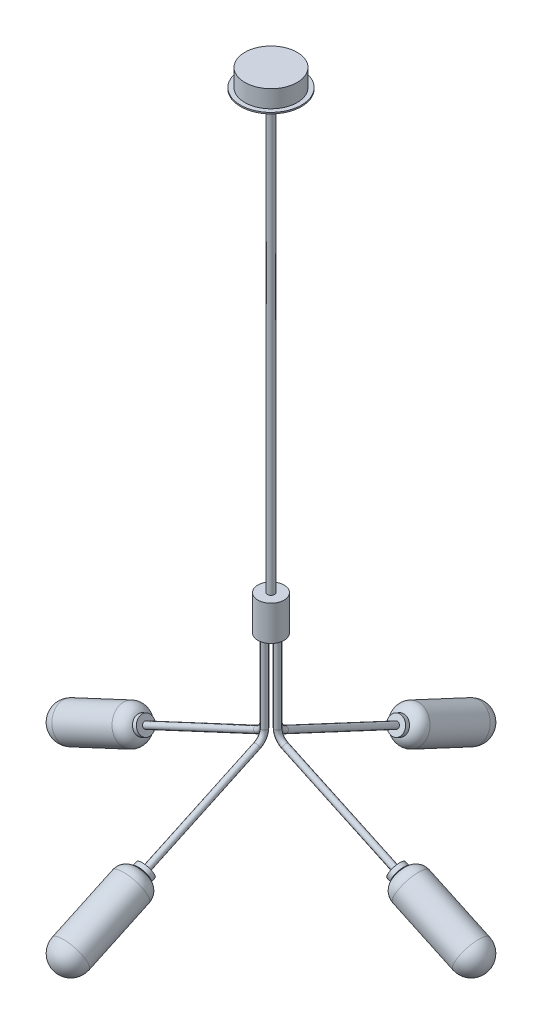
ISO-10303-21;
HEADER;
FILE_DESCRIPTION(('STEP AP214'),'2;1');
FILE_NAME('part.step','',(''),(''),'','','');
FILE_SCHEMA(('AUTOMOTIVE_DESIGN { 1 0 10303 214 1 1 1 1 }'));
ENDSEC;
DATA;
#1=APPLICATION_CONTEXT('core data for automotive mechanical design processes');
#2=APPLICATION_PROTOCOL_DEFINITION('international standard','automotive_design',2000,#1);
#3=PRODUCT_CONTEXT('',#1,'mechanical');
#4=PRODUCT('Part','Part','',(#3));
#5=PRODUCT_RELATED_PRODUCT_CATEGORY('part','',(#4));
#6=PRODUCT_DEFINITION_FORMATION('','',#4);
#7=PRODUCT_DEFINITION_CONTEXT('part definition',#1,'design');
#8=PRODUCT_DEFINITION('design','',#6,#7);
#9=PRODUCT_DEFINITION_SHAPE('','',#8);
#10=(LENGTH_UNIT() NAMED_UNIT(*) SI_UNIT(.MILLI.,.METRE.));
#11=(NAMED_UNIT(*) PLANE_ANGLE_UNIT() SI_UNIT($,.RADIAN.));
#12=(NAMED_UNIT(*) SI_UNIT($,.STERADIAN.) SOLID_ANGLE_UNIT());
#13=UNCERTAINTY_MEASURE_WITH_UNIT(LENGTH_MEASURE(1.E-05),#10,'distance_accuracy_value','');
#14=(GEOMETRIC_REPRESENTATION_CONTEXT(3) GLOBAL_UNCERTAINTY_ASSIGNED_CONTEXT((#13)) GLOBAL_UNIT_ASSIGNED_CONTEXT((#10,
#11,#12)) REPRESENTATION_CONTEXT('',''));
#15=CARTESIAN_POINT('',(0.,0.,0.));
#16=DIRECTION('',(0.,0.,1.));
#17=DIRECTION('',(1.,0.,0.));
#18=AXIS2_PLACEMENT_3D('',#15,#16,#17);
#19=CARTESIAN_POINT('',(-6.0330561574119,-285.450832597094,101.407013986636));
#20=DIRECTION('',(0.,-0.422618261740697,-0.906307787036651));
#21=DIRECTION('',(0.995263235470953,0.0881082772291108,-0.0410855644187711));
#22=AXIS2_PLACEMENT_3D('',#19,#20,#21);
#23=PLANE('',#22);
#24=CARTESIAN_POINT('',(-6.0330561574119,-285.450832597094,101.407013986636));
#25=DIRECTION('',(0.,-0.422618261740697,-0.906307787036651));
#26=DIRECTION('',(0.995263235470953,0.0881082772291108,-0.0410855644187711));
#27=AXIS2_PLACEMENT_3D('',#24,#25,#26);
#28=CIRCLE('',#27,20.);
#29=CARTESIAN_POINT('',(13.8722085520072,-283.688667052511,100.58530269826));
#30=VERTEX_POINT('',#29);
#31=EDGE_CURVE('P0_E10',#30,#30,#28,.T.);
#32=ORIENTED_EDGE('',*,*,#31,.T.);
#33=EDGE_LOOP('',(#32));
#34=FACE_BOUND('',#33,.T.);
#35=ADVANCED_FACE('P0_F15',(#34),#23,.T.);
#36=CARTESIAN_POINT('',(-6.0330561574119,-285.450832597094,101.407013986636));
#37=DIRECTION('',(0.,-0.422618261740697,-0.906307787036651));
#38=DIRECTION('',(0.995263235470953,0.0881082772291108,-0.0410855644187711));
#39=AXIS2_PLACEMENT_3D('',#36,#37,#38);
#40=CYLINDRICAL_SURFACE('',#39,20.);
#41=CARTESIAN_POINT('',(-6.03305615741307,-204.419105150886,275.180114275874));
#42=DIRECTION('',(0.,-0.422618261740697,-0.906307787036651));
#43=DIRECTION('',(0.995263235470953,0.0881082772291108,-0.0410855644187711));
#44=AXIS2_PLACEMENT_3D('',#41,#42,#43);
#45=CIRCLE('',#44,20.);
#46=CARTESIAN_POINT('',(13.872208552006,-202.656939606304,274.358402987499));
#47=VERTEX_POINT('',#46);
#48=EDGE_CURVE('P0_E21',#47,#47,#45,.T.);
#49=ORIENTED_EDGE('',*,*,#48,.T.);
#50=EDGE_LOOP('',(#49));
#51=FACE_BOUND('',#50,.T.);
#52=ORIENTED_EDGE('',*,*,#31,.F.);
#53=EDGE_LOOP('',(#52));
#54=FACE_BOUND('',#53,.T.);
#55=ADVANCED_FACE('P0_F27',(#51,#54),#40,.T.);
#56=CARTESIAN_POINT('',(-4.0887216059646,-222.459401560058,283.592442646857));
#57=DIRECTION('',(0.,0.422618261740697,0.906307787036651));
#58=DIRECTION('',(-0.995263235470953,-0.0881082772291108,0.0410855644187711));
#59=AXIS2_PLACEMENT_3D('',#56,#57,#58);
#60=PLANE('',#59);
#61=ORIENTED_EDGE('',*,*,#48,.F.);
#62=EDGE_LOOP('',(#61));
#63=FACE_BOUND('',#62,.T.);
#64=ADVANCED_FACE('P0_F30',(#63),#60,.T.);
#65=CLOSED_SHELL('',(#35,#55,#64));
#66=MANIFOLD_SOLID_BREP('P0_B1',#65);
#67=CARTESIAN_POINT('',(-6.03305615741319,-196.198624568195,292.808991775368));
#68=DIRECTION('',(0.,-0.422618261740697,-0.906307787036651));
#69=DIRECTION('',(0.995263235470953,0.0881082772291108,-0.0410855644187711));
#70=AXIS2_PLACEMENT_3D('',#67,#68,#69);
#71=CYLINDRICAL_SURFACE('',#70,20.);
#72=CARTESIAN_POINT('',(-6.03305615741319,-196.198624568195,292.808991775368));
#73=DIRECTION('',(0.,0.422618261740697,0.906307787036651));
#74=DIRECTION('',(-0.995263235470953,-0.0881082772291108,0.0410855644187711));
#75=AXIS2_PLACEMENT_3D('',#72,#73,#74);
#76=CIRCLE('',#75,20.);
#77=CARTESIAN_POINT('',(-25.9383208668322,-197.960790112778,293.630703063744));
#78=VERTEX_POINT('',#77);
#79=EDGE_CURVE('P1_E10',#78,#78,#76,.T.);
#80=ORIENTED_EDGE('',*,*,#79,.F.);
#81=EDGE_LOOP('',(#80));
#82=FACE_BOUND('',#81,.T.);
#83=CARTESIAN_POINT('',(-6.03305615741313,-200.424807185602,283.745913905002));
#84=DIRECTION('',(0.,0.422618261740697,0.906307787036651));
#85=DIRECTION('',(-0.995263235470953,-0.0881082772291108,0.0410855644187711));
#86=AXIS2_PLACEMENT_3D('',#83,#84,#85);
#87=CIRCLE('',#86,20.);
#88=CARTESIAN_POINT('',(-25.9383208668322,-202.186972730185,284.567625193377));
#89=VERTEX_POINT('',#88);
#90=EDGE_CURVE('P1_E18',#89,#89,#87,.T.);
#91=ORIENTED_EDGE('',*,*,#90,.T.);
#92=EDGE_LOOP('',(#91));
#93=FACE_BOUND('',#92,.T.);
#94=ADVANCED_FACE('P1_F15',(#82,#93),#71,.T.);
#95=CARTESIAN_POINT('',(-6.03305615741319,-196.198624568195,292.808991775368));
#96=DIRECTION('',(0.,0.422618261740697,0.906307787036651));
#97=DIRECTION('',(-0.995263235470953,-0.0881082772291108,0.0410855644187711));
#98=AXIS2_PLACEMENT_3D('',#95,#96,#97);
#99=PLANE('',#98);
#100=ORIENTED_EDGE('',*,*,#79,.T.);
#101=EDGE_LOOP('',(#100));
#102=FACE_BOUND('',#101,.T.);
#103=ADVANCED_FACE('P1_F30',(#102),#99,.T.);
#104=CARTESIAN_POINT('',(-6.03305615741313,-200.424807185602,283.745913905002));
#105=DIRECTION('',(0.,0.422618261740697,0.906307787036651));
#106=DIRECTION('',(-0.995263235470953,-0.0881082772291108,0.0410855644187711));
#107=AXIS2_PLACEMENT_3D('',#104,#105,#106);
#108=PLANE('',#107);
#109=ORIENTED_EDGE('',*,*,#90,.F.);
#110=EDGE_LOOP('',(#109));
#111=FACE_BOUND('',#110,.T.);
#112=ADVANCED_FACE('P1_F28',(#111),#108,.F.);
#113=CLOSED_SHELL('',(#94,#103,#112));
#114=MANIFOLD_SOLID_BREP('P1_B1',#113);
#115=CARTESIAN_POINT('',(-6.03305615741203,-276.496094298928,120.610512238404));
#116=DIRECTION('',(0.,-0.422618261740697,-0.906307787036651));
#117=DIRECTION('',(-0.0972167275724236,0.902014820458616,-0.420616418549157));
#118=AXIS2_PLACEMENT_3D('',#115,#116,#117);
#119=SPHERICAL_SURFACE('',#118,40.);
#120=CARTESIAN_POINT('',(-6.03305615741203,-276.496094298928,120.610512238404));
#121=DIRECTION('',(0.,-0.422618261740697,-0.906307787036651));
#122=DIRECTION('',(0.995263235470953,0.0881082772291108,-0.0410855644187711));
#123=AXIS2_PLACEMENT_3D('',#120,#121,#122);
#124=CIRCLE('',#123,40.);
#125=CARTESIAN_POINT('',(33.7774732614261,-272.971763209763,118.967089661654));
#126=VERTEX_POINT('',#125);
#127=EDGE_CURVE('P2_E39',#126,#126,#124,.T.);
#128=ORIENTED_EDGE('',*,*,#127,.T.);
#129=EDGE_LOOP('',(#128));
#130=FACE_BOUND('',#129,.T.);
#131=ADVANCED_FACE('P2_F16',(#130),#119,.T.);
#132=CARTESIAN_POINT('',(-6.03305615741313,-200.424807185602,283.745913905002));
#133=DIRECTION('',(0.,-0.422618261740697,-0.906307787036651));
#134=DIRECTION('',(0.995263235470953,0.0881082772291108,-0.0410855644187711));
#135=AXIS2_PLACEMENT_3D('',#132,#133,#134);
#136=PLANE('',#135);
#137=CARTESIAN_POINT('',(-6.03305615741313,-200.424807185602,283.745913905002));
#138=DIRECTION('',(0.,-0.422618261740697,-0.906307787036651));
#139=DIRECTION('',(0.995263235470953,0.0881082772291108,-0.0410855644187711));
#140=AXIS2_PLACEMENT_3D('',#137,#138,#139);
#141=CIRCLE('',#140,12.1875);
#142=CARTESIAN_POINT('',(6.0967145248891,-199.350987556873,283.245183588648));
#143=VERTEX_POINT('',#142);
#144=EDGE_CURVE('P2_E31',#143,#143,#141,.T.);
#145=ORIENTED_EDGE('',*,*,#144,.F.);
#146=EDGE_LOOP('',(#145));
#147=FACE_BOUND('',#146,.T.);
#148=ADVANCED_FACE('P2_F53',(#147),#136,.F.);
#149=CARTESIAN_POINT('',(-6.03305615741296,-212.178877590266,258.539228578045));
#150=DIRECTION('',(0.,-0.422618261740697,-0.906307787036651));
#151=DIRECTION('',(0.995263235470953,0.0881082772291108,-0.0410855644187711));
#152=AXIS2_PLACEMENT_3D('',#149,#150,#151);
#153=DEGENERATE_TOROIDAL_SURFACE('',#152,12.1875,27.8125,.T.);
#154=CARTESIAN_POINT('',(-6.03305615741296,-212.178877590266,258.539228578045));
#155=DIRECTION('',(0.,-0.422618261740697,-0.906307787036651));
#156=DIRECTION('',(0.995263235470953,0.0881082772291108,-0.0410855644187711));
#157=AXIS2_PLACEMENT_3D('',#154,#155,#156);
#158=CIRCLE('',#157,40.);
#159=CARTESIAN_POINT('',(33.7774732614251,-208.654546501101,256.895806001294));
#160=VERTEX_POINT('',#159);
#161=EDGE_CURVE('P2_E36',#160,#160,#158,.T.);
#162=ORIENTED_EDGE('',*,*,#161,.F.);
#163=EDGE_LOOP('',(#162));
#164=FACE_BOUND('',#163,.T.);
#165=ORIENTED_EDGE('',*,*,#144,.T.);
#166=EDGE_LOOP('',(#165));
#167=FACE_BOUND('',#166,.T.);
#168=ADVANCED_FACE('P2_F47',(#164,#167),#153,.T.);
#169=CARTESIAN_POINT('',(-6.03305615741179,-293.400824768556,84.3582007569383));
#170=DIRECTION('',(0.,-0.422618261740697,-0.906307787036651));
#171=DIRECTION('',(0.995263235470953,0.0881082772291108,-0.0410855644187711));
#172=AXIS2_PLACEMENT_3D('',#169,#170,#171);
#173=CYLINDRICAL_SURFACE('',#172,40.);
#174=ORIENTED_EDGE('',*,*,#127,.F.);
#175=EDGE_LOOP('',(#174));
#176=FACE_BOUND('',#175,.T.);
#177=ORIENTED_EDGE('',*,*,#161,.T.);
#178=EDGE_LOOP('',(#177));
#179=FACE_BOUND('',#178,.T.);
#180=ADVANCED_FACE('P2_F44',(#176,#179),#173,.T.);
#181=CLOSED_SHELL('',(#131,#148,#168,#180));
#182=CARTESIAN_POINT('',(-6.03305615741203,-276.496094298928,120.610512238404));
#183=DIRECTION('',(0.,-0.422618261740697,-0.906307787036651));
#184=DIRECTION('',(-0.0972167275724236,0.902014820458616,-0.420616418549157));
#185=AXIS2_PLACEMENT_3D('',#182,#183,#184);
#186=SPHERICAL_SURFACE('',#185,38.);
#187=CARTESIAN_POINT('',(-6.03305615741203,-276.496094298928,120.610512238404));
#188=DIRECTION('',(0.,-0.422618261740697,-0.906307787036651));
#189=DIRECTION('',(0.995263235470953,0.0881082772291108,-0.0410855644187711));
#190=AXIS2_PLACEMENT_3D('',#187,#188,#189);
#191=CIRCLE('',#190,38.);
#192=CARTESIAN_POINT('',(31.7869467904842,-273.147979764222,119.049260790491));
#193=VERTEX_POINT('',#192);
#194=EDGE_CURVE('P2_E10',#193,#193,#191,.T.);
#195=ORIENTED_EDGE('',*,*,#194,.F.);
#196=EDGE_LOOP('',(#195));
#197=FACE_BOUND('',#196,.T.);
#198=ADVANCED_FACE('P2_F75',(#197),#186,.F.);
#199=CARTESIAN_POINT('',(-6.03305615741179,-293.400824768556,84.3582007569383));
#200=DIRECTION('',(0.,-0.422618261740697,-0.906307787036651));
#201=DIRECTION('',(0.995263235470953,0.0881082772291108,-0.0410855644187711));
#202=AXIS2_PLACEMENT_3D('',#199,#200,#201);
#203=CYLINDRICAL_SURFACE('',#202,38.);
#204=CARTESIAN_POINT('',(-6.03305615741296,-212.178877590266,258.539228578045));
#205=DIRECTION('',(0.,-0.422618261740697,-0.906307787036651));
#206=DIRECTION('',(0.995263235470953,0.0881082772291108,-0.0410855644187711));
#207=AXIS2_PLACEMENT_3D('',#204,#205,#206);
#208=CIRCLE('',#207,38.);
#209=CARTESIAN_POINT('',(31.7869467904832,-208.830763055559,256.977977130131));
#210=VERTEX_POINT('',#209);
#211=EDGE_CURVE('P2_E23',#210,#210,#208,.T.);
#212=ORIENTED_EDGE('',*,*,#211,.F.);
#213=EDGE_LOOP('',(#212));
#214=FACE_BOUND('',#213,.T.);
#215=ORIENTED_EDGE('',*,*,#194,.T.);
#216=EDGE_LOOP('',(#215));
#217=FACE_BOUND('',#216,.T.);
#218=ADVANCED_FACE('P2_F72',(#214,#217),#203,.F.);
#219=CARTESIAN_POINT('',(-6.03305615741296,-212.178877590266,258.539228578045));
#220=DIRECTION('',(0.,-0.422618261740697,-0.906307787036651));
#221=DIRECTION('',(0.995263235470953,0.0881082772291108,-0.0410855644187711));
#222=AXIS2_PLACEMENT_3D('',#219,#220,#221);
#223=DEGENERATE_TOROIDAL_SURFACE('',#222,12.1875,25.8125,.T.);
#224=CARTESIAN_POINT('',(-6.03305615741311,-201.270043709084,281.933298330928));
#225=DIRECTION('',(0.,-0.422618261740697,-0.906307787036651));
#226=DIRECTION('',(0.995263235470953,0.0881082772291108,-0.0410855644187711));
#227=AXIS2_PLACEMENT_3D('',#224,#225,#226);
#228=CIRCLE('',#227,12.1875);
#229=CARTESIAN_POINT('',(6.09671452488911,-200.196224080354,281.432568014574));
#230=VERTEX_POINT('',#229);
#231=EDGE_CURVE('P2_E27',#230,#230,#228,.T.);
#232=ORIENTED_EDGE('',*,*,#231,.F.);
#233=EDGE_LOOP('',(#232));
#234=FACE_BOUND('',#233,.T.);
#235=ORIENTED_EDGE('',*,*,#211,.T.);
#236=EDGE_LOOP('',(#235));
#237=FACE_BOUND('',#236,.T.);
#238=ADVANCED_FACE('P2_F67',(#234,#237),#223,.F.);
#239=CARTESIAN_POINT('',(-6.03305615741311,-201.270043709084,281.933298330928));
#240=DIRECTION('',(0.,0.422618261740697,0.906307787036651));
#241=DIRECTION('',(-0.995263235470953,-0.0881082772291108,0.0410855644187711));
#242=AXIS2_PLACEMENT_3D('',#239,#240,#241);
#243=PLANE('',#242);
#244=ORIENTED_EDGE('',*,*,#231,.T.);
#245=EDGE_LOOP('',(#244));
#246=FACE_BOUND('',#245,.T.);
#247=ADVANCED_FACE('P2_F64',(#246),#243,.F.);
#248=CLOSED_SHELL('',(#198,#218,#238,#247));
#249=ORIENTED_CLOSED_SHELL('',*,#248,.T.);
#250=BREP_WITH_VOIDS('P2_B1',#181,(#249));
#251=CARTESIAN_POINT('',(-6.03305615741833,-285.450832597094,1057.99564178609));
#252=DIRECTION('',(0.,-0.422618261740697,0.906307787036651));
#253=DIRECTION('',(-0.995263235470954,0.0881082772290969,0.0410855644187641));
#254=AXIS2_PLACEMENT_3D('',#251,#252,#253);
#255=PLANE('',#254);
#256=CARTESIAN_POINT('',(-6.03305615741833,-285.450832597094,1057.99564178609));
#257=DIRECTION('',(0.,-0.422618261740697,0.906307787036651));
#258=DIRECTION('',(-0.995263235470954,0.0881082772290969,0.0410855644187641));
#259=AXIS2_PLACEMENT_3D('',#256,#257,#258);
#260=CIRCLE('',#259,20.);
#261=CARTESIAN_POINT('',(-25.9383208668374,-283.688667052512,1058.81735307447));
#262=VERTEX_POINT('',#261);
#263=EDGE_CURVE('P3_E9',#262,#262,#260,.T.);
#264=ORIENTED_EDGE('',*,*,#263,.T.);
#265=EDGE_LOOP('',(#264));
#266=FACE_BOUND('',#265,.T.);
#267=ADVANCED_FACE('P3_F14',(#266),#255,.T.);
#268=CARTESIAN_POINT('',(-6.03305615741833,-285.450832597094,1057.99564178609));
#269=DIRECTION('',(0.,-0.422618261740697,0.906307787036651));
#270=DIRECTION('',(-0.995263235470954,0.0881082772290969,0.0410855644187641));
#271=AXIS2_PLACEMENT_3D('',#268,#269,#270);
#272=CYLINDRICAL_SURFACE('',#271,20.);
#273=CARTESIAN_POINT('',(-6.03305615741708,-204.419105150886,884.222541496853));
#274=DIRECTION('',(0.,-0.422618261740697,0.906307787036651));
#275=DIRECTION('',(-0.995263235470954,0.0881082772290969,0.0410855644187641));
#276=AXIS2_PLACEMENT_3D('',#273,#274,#275);
#277=CIRCLE('',#276,20.);
#278=CARTESIAN_POINT('',(-25.9383208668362,-202.656939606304,885.044252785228));
#279=VERTEX_POINT('',#278);
#280=EDGE_CURVE('P3_E20',#279,#279,#277,.T.);
#281=ORIENTED_EDGE('',*,*,#280,.T.);
#282=EDGE_LOOP('',(#281));
#283=FACE_BOUND('',#282,.T.);
#284=ORIENTED_EDGE('',*,*,#263,.F.);
#285=EDGE_LOOP('',(#284));
#286=FACE_BOUND('',#285,.T.);
#287=ADVANCED_FACE('P3_F26',(#283,#286),#272,.T.);
#288=CARTESIAN_POINT('',(-7.97739070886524,-222.459401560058,875.810213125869));
#289=DIRECTION('',(0.,0.422618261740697,-0.906307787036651));
#290=DIRECTION('',(0.995263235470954,-0.0881082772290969,-0.0410855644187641));
#291=AXIS2_PLACEMENT_3D('',#288,#289,#290);
#292=PLANE('',#291);
#293=ORIENTED_EDGE('',*,*,#280,.F.);
#294=EDGE_LOOP('',(#293));
#295=FACE_BOUND('',#294,.T.);
#296=ADVANCED_FACE('P3_F29',(#295),#292,.T.);
#297=CLOSED_SHELL('',(#267,#287,#296));
#298=MANIFOLD_SOLID_BREP('P3_B1',#297);
#299=CARTESIAN_POINT('',(-6.03305615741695,-196.198624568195,866.593663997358));
#300=DIRECTION('',(0.,-0.422618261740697,0.906307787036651));
#301=DIRECTION('',(-0.995263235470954,0.0881082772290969,0.0410855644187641));
#302=AXIS2_PLACEMENT_3D('',#299,#300,#301);
#303=CYLINDRICAL_SURFACE('',#302,20.);
#304=CARTESIAN_POINT('',(-6.03305615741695,-196.198624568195,866.593663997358));
#305=DIRECTION('',(0.,0.422618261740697,-0.906307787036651));
#306=DIRECTION('',(0.995263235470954,-0.0881082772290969,-0.0410855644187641));
#307=AXIS2_PLACEMENT_3D('',#304,#305,#306);
#308=CIRCLE('',#307,20.);
#309=CARTESIAN_POINT('',(13.8722085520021,-197.960790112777,865.771952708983));
#310=VERTEX_POINT('',#309);
#311=EDGE_CURVE('P4_E10',#310,#310,#308,.T.);
#312=ORIENTED_EDGE('',*,*,#311,.F.);
#313=EDGE_LOOP('',(#312));
#314=FACE_BOUND('',#313,.T.);
#315=CARTESIAN_POINT('',(-6.03305615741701,-200.424807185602,875.656741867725));
#316=DIRECTION('',(0.,0.422618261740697,-0.906307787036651));
#317=DIRECTION('',(0.995263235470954,-0.0881082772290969,-0.0410855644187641));
#318=AXIS2_PLACEMENT_3D('',#315,#316,#317);
#319=CIRCLE('',#318,20.);
#320=CARTESIAN_POINT('',(13.8722085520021,-202.186972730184,874.83503057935));
#321=VERTEX_POINT('',#320);
#322=EDGE_CURVE('P4_E18',#321,#321,#319,.T.);
#323=ORIENTED_EDGE('',*,*,#322,.T.);
#324=EDGE_LOOP('',(#323));
#325=FACE_BOUND('',#324,.T.);
#326=ADVANCED_FACE('P4_F15',(#314,#325),#303,.T.);
#327=CARTESIAN_POINT('',(-6.03305615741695,-196.198624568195,866.593663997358));
#328=DIRECTION('',(0.,0.422618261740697,-0.906307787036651));
#329=DIRECTION('',(0.995263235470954,-0.0881082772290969,-0.0410855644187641));
#330=AXIS2_PLACEMENT_3D('',#327,#328,#329);
#331=PLANE('',#330);
#332=ORIENTED_EDGE('',*,*,#311,.T.);
#333=EDGE_LOOP('',(#332));
#334=FACE_BOUND('',#333,.T.);
#335=ADVANCED_FACE('P4_F30',(#334),#331,.T.);
#336=CARTESIAN_POINT('',(-6.03305615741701,-200.424807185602,875.656741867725));
#337=DIRECTION('',(0.,0.422618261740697,-0.906307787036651));
#338=DIRECTION('',(0.995263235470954,-0.0881082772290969,-0.0410855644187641));
#339=AXIS2_PLACEMENT_3D('',#336,#337,#338);
#340=PLANE('',#339);
#341=ORIENTED_EDGE('',*,*,#322,.F.);
#342=EDGE_LOOP('',(#341));
#343=FACE_BOUND('',#342,.T.);
#344=ADVANCED_FACE('P4_F28',(#343),#340,.F.);
#345=CLOSED_SHELL('',(#326,#335,#344));
#346=MANIFOLD_SOLID_BREP('P4_B1',#345);
#347=CARTESIAN_POINT('',(-6.03305615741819,-276.496094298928,1038.79214353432));
#348=DIRECTION('',(0.,-0.422618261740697,0.906307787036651));
#349=DIRECTION('',(0.0972167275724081,0.902014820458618,0.420616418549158));
#350=AXIS2_PLACEMENT_3D('',#347,#348,#349);
#351=SPHERICAL_SURFACE('',#350,40.);
#352=CARTESIAN_POINT('',(-6.03305615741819,-276.496094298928,1038.79214353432));
#353=DIRECTION('',(0.,-0.422618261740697,0.906307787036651));
#354=DIRECTION('',(-0.995263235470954,0.0881082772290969,0.0410855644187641));
#355=AXIS2_PLACEMENT_3D('',#352,#353,#354);
#356=CIRCLE('',#355,40.);
#357=CARTESIAN_POINT('',(-45.8435855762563,-272.971763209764,1040.43556611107));
#358=VERTEX_POINT('',#357);
#359=EDGE_CURVE('P5_E39',#358,#358,#356,.T.);
#360=ORIENTED_EDGE('',*,*,#359,.T.);
#361=EDGE_LOOP('',(#360));
#362=FACE_BOUND('',#361,.T.);
#363=ADVANCED_FACE('P5_F16',(#362),#351,.T.);
#364=CARTESIAN_POINT('',(-6.03305615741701,-200.424807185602,875.656741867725));
#365=DIRECTION('',(0.,-0.422618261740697,0.906307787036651));
#366=DIRECTION('',(-0.995263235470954,0.0881082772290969,0.0410855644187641));
#367=AXIS2_PLACEMENT_3D('',#364,#365,#366);
#368=PLANE('',#367);
#369=CARTESIAN_POINT('',(-6.03305615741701,-200.424807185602,875.656741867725));
#370=DIRECTION('',(0.,-0.422618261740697,0.906307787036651));
#371=DIRECTION('',(-0.995263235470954,0.0881082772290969,0.0410855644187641));
#372=AXIS2_PLACEMENT_3D('',#369,#370,#371);
#373=CIRCLE('',#372,12.1875);
#374=CARTESIAN_POINT('',(-18.1628268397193,-199.350987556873,876.157472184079));
#375=VERTEX_POINT('',#374);
#376=EDGE_CURVE('P5_E31',#375,#375,#373,.T.);
#377=ORIENTED_EDGE('',*,*,#376,.F.);
#378=EDGE_LOOP('',(#377));
#379=FACE_BOUND('',#378,.T.);
#380=ADVANCED_FACE('P5_F53',(#379),#368,.F.);
#381=CARTESIAN_POINT('',(-6.0330561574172,-212.178877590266,900.863427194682));
#382=DIRECTION('',(0.,-0.422618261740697,0.906307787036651));
#383=DIRECTION('',(-0.995263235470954,0.0881082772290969,0.0410855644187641));
#384=AXIS2_PLACEMENT_3D('',#381,#382,#383);
#385=DEGENERATE_TOROIDAL_SURFACE('',#384,12.1875,27.8125,.T.);
#386=CARTESIAN_POINT('',(-6.0330561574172,-212.178877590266,900.863427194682));
#387=DIRECTION('',(0.,-0.422618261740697,0.906307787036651));
#388=DIRECTION('',(-0.995263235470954,0.0881082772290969,0.0410855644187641));
#389=AXIS2_PLACEMENT_3D('',#386,#387,#388);
#390=CIRCLE('',#389,40.);
#391=CARTESIAN_POINT('',(-45.8435855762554,-208.654546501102,902.506849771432));
#392=VERTEX_POINT('',#391);
#393=EDGE_CURVE('P5_E36',#392,#392,#390,.T.);
#394=ORIENTED_EDGE('',*,*,#393,.F.);
#395=EDGE_LOOP('',(#394));
#396=FACE_BOUND('',#395,.T.);
#397=ORIENTED_EDGE('',*,*,#376,.T.);
#398=EDGE_LOOP('',(#397));
#399=FACE_BOUND('',#398,.T.);
#400=ADVANCED_FACE('P5_F47',(#396,#399),#385,.T.);
#401=CARTESIAN_POINT('',(-6.03305615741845,-293.400824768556,1075.04445501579));
#402=DIRECTION('',(0.,-0.422618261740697,0.906307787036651));
#403=DIRECTION('',(-0.995263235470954,0.0881082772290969,0.0410855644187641));
#404=AXIS2_PLACEMENT_3D('',#401,#402,#403);
#405=CYLINDRICAL_SURFACE('',#404,40.);
#406=ORIENTED_EDGE('',*,*,#359,.F.);
#407=EDGE_LOOP('',(#406));
#408=FACE_BOUND('',#407,.T.);
#409=ORIENTED_EDGE('',*,*,#393,.T.);
#410=EDGE_LOOP('',(#409));
#411=FACE_BOUND('',#410,.T.);
#412=ADVANCED_FACE('P5_F44',(#408,#411),#405,.T.);
#413=CLOSED_SHELL('',(#363,#380,#400,#412));
#414=CARTESIAN_POINT('',(-6.03305615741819,-276.496094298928,1038.79214353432));
#415=DIRECTION('',(0.,-0.422618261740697,0.906307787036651));
#416=DIRECTION('',(0.0972167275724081,0.902014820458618,0.420616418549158));
#417=AXIS2_PLACEMENT_3D('',#414,#415,#416);
#418=SPHERICAL_SURFACE('',#417,38.);
#419=CARTESIAN_POINT('',(-6.03305615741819,-276.496094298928,1038.79214353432));
#420=DIRECTION('',(0.,-0.422618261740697,0.906307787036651));
#421=DIRECTION('',(-0.995263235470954,0.0881082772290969,0.0410855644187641));
#422=AXIS2_PLACEMENT_3D('',#419,#420,#421);
#423=CIRCLE('',#422,38.);
#424=CARTESIAN_POINT('',(-43.8530591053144,-273.147979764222,1040.35339498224));
#425=VERTEX_POINT('',#424);
#426=EDGE_CURVE('P5_E10',#425,#425,#423,.T.);
#427=ORIENTED_EDGE('',*,*,#426,.F.);
#428=EDGE_LOOP('',(#427));
#429=FACE_BOUND('',#428,.T.);
#430=ADVANCED_FACE('P5_F75',(#429),#418,.F.);
#431=CARTESIAN_POINT('',(-6.03305615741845,-293.400824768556,1075.04445501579));
#432=DIRECTION('',(0.,-0.422618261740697,0.906307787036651));
#433=DIRECTION('',(-0.995263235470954,0.0881082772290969,0.0410855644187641));
#434=AXIS2_PLACEMENT_3D('',#431,#432,#433);
#435=CYLINDRICAL_SURFACE('',#434,38.);
#436=CARTESIAN_POINT('',(-6.0330561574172,-212.178877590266,900.863427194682));
#437=DIRECTION('',(0.,-0.422618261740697,0.906307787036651));
#438=DIRECTION('',(-0.995263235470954,0.0881082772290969,0.0410855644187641));
#439=AXIS2_PLACEMENT_3D('',#436,#437,#438);
#440=CIRCLE('',#439,38.);
#441=CARTESIAN_POINT('',(-43.8530591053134,-208.83076305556,902.424678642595));
#442=VERTEX_POINT('',#441);
#443=EDGE_CURVE('P5_E23',#442,#442,#440,.T.);
#444=ORIENTED_EDGE('',*,*,#443,.F.);
#445=EDGE_LOOP('',(#444));
#446=FACE_BOUND('',#445,.T.);
#447=ORIENTED_EDGE('',*,*,#426,.T.);
#448=EDGE_LOOP('',(#447));
#449=FACE_BOUND('',#448,.T.);
#450=ADVANCED_FACE('P5_F72',(#446,#449),#435,.F.);
#451=CARTESIAN_POINT('',(-6.0330561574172,-212.178877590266,900.863427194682));
#452=DIRECTION('',(0.,-0.422618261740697,0.906307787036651));
#453=DIRECTION('',(-0.995263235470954,0.0881082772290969,0.0410855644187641));
#454=AXIS2_PLACEMENT_3D('',#451,#452,#453);
#455=DEGENERATE_TOROIDAL_SURFACE('',#454,12.1875,25.8125,.T.);
#456=CARTESIAN_POINT('',(-6.03305615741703,-201.270043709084,877.469357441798));
#457=DIRECTION('',(0.,-0.422618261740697,0.906307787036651));
#458=DIRECTION('',(-0.995263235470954,0.0881082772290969,0.0410855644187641));
#459=AXIS2_PLACEMENT_3D('',#456,#457,#458);
#460=CIRCLE('',#459,12.1875);
#461=CARTESIAN_POINT('',(-18.1628268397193,-200.196224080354,877.970087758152));
#462=VERTEX_POINT('',#461);
#463=EDGE_CURVE('P5_E27',#462,#462,#460,.T.);
#464=ORIENTED_EDGE('',*,*,#463,.F.);
#465=EDGE_LOOP('',(#464));
#466=FACE_BOUND('',#465,.T.);
#467=ORIENTED_EDGE('',*,*,#443,.T.);
#468=EDGE_LOOP('',(#467));
#469=FACE_BOUND('',#468,.T.);
#470=ADVANCED_FACE('P5_F67',(#466,#469),#455,.F.);
#471=CARTESIAN_POINT('',(-6.03305615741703,-201.270043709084,877.469357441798));
#472=DIRECTION('',(0.,0.422618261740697,-0.906307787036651));
#473=DIRECTION('',(0.995263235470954,-0.0881082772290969,-0.0410855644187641));
#474=AXIS2_PLACEMENT_3D('',#471,#472,#473);
#475=PLANE('',#474);
#476=ORIENTED_EDGE('',*,*,#463,.T.);
#477=EDGE_LOOP('',(#476));
#478=FACE_BOUND('',#477,.T.);
#479=ADVANCED_FACE('P5_F64',(#478),#475,.F.);
#480=CLOSED_SHELL('',(#430,#450,#470,#479));
#481=ORIENTED_CLOSED_SHELL('',*,#480,.T.);
#482=BREP_WITH_VOIDS('P5_B1',#413,(#481));
#483=CARTESIAN_POINT('',(-6.03305615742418,1253.58685395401,579.701327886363));
#484=DIRECTION('',(0.,-1.,0.));
#485=DIRECTION('',(0.,0.,1.));
#486=AXIS2_PLACEMENT_3D('',#483,#484,#485);
#487=CYLINDRICAL_SURFACE('',#486,60.);
#488=CARTESIAN_POINT('',(-6.03305615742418,1253.58685395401,579.701327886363));
#489=DIRECTION('',(0.,1.,0.));
#490=DIRECTION('',(0.,0.,-1.));
#491=AXIS2_PLACEMENT_3D('',#488,#489,#490);
#492=CIRCLE('',#491,60.);
#493=CARTESIAN_POINT('',(-6.03305615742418,1253.58685395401,519.701327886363));
#494=VERTEX_POINT('',#493);
#495=EDGE_CURVE('P6_E10',#494,#494,#492,.T.);
#496=ORIENTED_EDGE('',*,*,#495,.F.);
#497=EDGE_LOOP('',(#496));
#498=FACE_BOUND('',#497,.T.);
#499=CARTESIAN_POINT('',(-6.0330561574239,1213.58685395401,579.701327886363));
#500=DIRECTION('',(0.,1.,0.));
#501=DIRECTION('',(0.,0.,-1.));
#502=AXIS2_PLACEMENT_3D('',#499,#500,#501);
#503=CIRCLE('',#502,60.);
#504=CARTESIAN_POINT('',(-6.0330561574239,1213.58685395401,519.701327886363));
#505=VERTEX_POINT('',#504);
#506=EDGE_CURVE('P6_E18',#505,#505,#503,.T.);
#507=ORIENTED_EDGE('',*,*,#506,.T.);
#508=EDGE_LOOP('',(#507));
#509=FACE_BOUND('',#508,.T.);
#510=ADVANCED_FACE('P6_F15',(#498,#509),#487,.T.);
#511=CARTESIAN_POINT('',(-6.03305615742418,1253.58685395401,579.701327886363));
#512=DIRECTION('',(0.,1.,0.));
#513=DIRECTION('',(0.,0.,-1.));
#514=AXIS2_PLACEMENT_3D('',#511,#512,#513);
#515=PLANE('',#514);
#516=ORIENTED_EDGE('',*,*,#495,.T.);
#517=EDGE_LOOP('',(#516));
#518=FACE_BOUND('',#517,.T.);
#519=ADVANCED_FACE('P6_F30',(#518),#515,.T.);
#520=CARTESIAN_POINT('',(-6.0330561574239,1213.58685395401,579.701327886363));
#521=DIRECTION('',(0.,1.,0.));
#522=DIRECTION('',(0.,0.,-1.));
#523=AXIS2_PLACEMENT_3D('',#520,#521,#522);
#524=PLANE('',#523);
#525=ORIENTED_EDGE('',*,*,#506,.F.);
#526=EDGE_LOOP('',(#525));
#527=FACE_BOUND('',#526,.T.);
#528=ADVANCED_FACE('P6_F28',(#527),#524,.F.);
#529=CLOSED_SHELL('',(#510,#519,#528));
#530=MANIFOLD_SOLID_BREP('P6_B1',#529);
#531=CARTESIAN_POINT('',(-6.0330561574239,1213.58685395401,579.701327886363));
#532=DIRECTION('',(0.,-1.,0.));
#533=DIRECTION('',(0.,0.,1.));
#534=AXIS2_PLACEMENT_3D('',#531,#532,#533);
#535=CYLINDRICAL_SURFACE('',#534,70.);
#536=CARTESIAN_POINT('',(-6.0330561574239,1213.58685395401,579.701327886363));
#537=DIRECTION('',(0.,1.,0.));
#538=DIRECTION('',(0.,0.,-1.));
#539=AXIS2_PLACEMENT_3D('',#536,#537,#538);
#540=CIRCLE('',#539,70.);
#541=CARTESIAN_POINT('',(-6.0330561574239,1213.58685395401,509.701327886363));
#542=VERTEX_POINT('',#541);
#543=EDGE_CURVE('P7_E10',#542,#542,#540,.T.);
#544=ORIENTED_EDGE('',*,*,#543,.F.);
#545=EDGE_LOOP('',(#544));
#546=FACE_BOUND('',#545,.T.);
#547=CARTESIAN_POINT('',(-6.03305615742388,1210.58685395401,579.701327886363));
#548=DIRECTION('',(0.,1.,0.));
#549=DIRECTION('',(0.,0.,-1.));
#550=AXIS2_PLACEMENT_3D('',#547,#548,#549);
#551=CIRCLE('',#550,70.);
#552=CARTESIAN_POINT('',(-6.03305615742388,1210.58685395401,509.701327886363));
#553=VERTEX_POINT('',#552);
#554=EDGE_CURVE('P7_E18',#553,#553,#551,.T.);
#555=ORIENTED_EDGE('',*,*,#554,.T.);
#556=EDGE_LOOP('',(#555));
#557=FACE_BOUND('',#556,.T.);
#558=ADVANCED_FACE('P7_F15',(#546,#557),#535,.T.);
#559=CARTESIAN_POINT('',(-6.0330561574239,1213.58685395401,579.701327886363));
#560=DIRECTION('',(0.,1.,0.));
#561=DIRECTION('',(0.,0.,-1.));
#562=AXIS2_PLACEMENT_3D('',#559,#560,#561);
#563=PLANE('',#562);
#564=ORIENTED_EDGE('',*,*,#543,.T.);
#565=EDGE_LOOP('',(#564));
#566=FACE_BOUND('',#565,.T.);
#567=ADVANCED_FACE('P7_F30',(#566),#563,.T.);
#568=CARTESIAN_POINT('',(-6.03305615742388,1210.58685395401,579.701327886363));
#569=DIRECTION('',(0.,1.,0.));
#570=DIRECTION('',(0.,0.,-1.));
#571=AXIS2_PLACEMENT_3D('',#568,#569,#570);
#572=PLANE('',#571);
#573=ORIENTED_EDGE('',*,*,#554,.F.);
#574=EDGE_LOOP('',(#573));
#575=FACE_BOUND('',#574,.T.);
#576=ADVANCED_FACE('P7_F28',(#575),#572,.F.);
#577=CLOSED_SHELL('',(#558,#567,#576));
#578=MANIFOLD_SOLID_BREP('P7_B1',#577);
#579=CARTESIAN_POINT('',(-6.03305615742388,1210.58685395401,579.701327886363));
#580=DIRECTION('',(0.,-1.,0.));
#581=DIRECTION('',(0.,0.,1.));
#582=AXIS2_PLACEMENT_3D('',#579,#580,#581);
#583=CYLINDRICAL_SURFACE('',#582,8.);
#584=CARTESIAN_POINT('',(-6.03305615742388,1210.58685395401,579.701327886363));
#585=DIRECTION('',(0.,1.,0.));
#586=DIRECTION('',(0.,0.,-1.));
#587=AXIS2_PLACEMENT_3D('',#584,#585,#586);
#588=CIRCLE('',#587,8.);
#589=CARTESIAN_POINT('',(-6.03305615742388,1210.58685395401,571.701327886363));
#590=VERTEX_POINT('',#589);
#591=EDGE_CURVE('P8_E10',#590,#590,#588,.T.);
#592=ORIENTED_EDGE('',*,*,#591,.F.);
#593=EDGE_LOOP('',(#592));
#594=FACE_BOUND('',#593,.T.);
#595=CARTESIAN_POINT('',(-6.03305615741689,210.586853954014,579.701327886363));
#596=DIRECTION('',(0.,1.,0.));
#597=DIRECTION('',(0.,0.,-1.));
#598=AXIS2_PLACEMENT_3D('',#595,#596,#597);
#599=CIRCLE('',#598,8.);
#600=CARTESIAN_POINT('',(-6.03305615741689,210.586853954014,571.701327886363));
#601=VERTEX_POINT('',#600);
#602=EDGE_CURVE('P8_E18',#601,#601,#599,.T.);
#603=ORIENTED_EDGE('',*,*,#602,.T.);
#604=EDGE_LOOP('',(#603));
#605=FACE_BOUND('',#604,.T.);
#606=ADVANCED_FACE('P8_F15',(#594,#605),#583,.T.);
#607=CARTESIAN_POINT('',(-6.03305615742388,1210.58685395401,579.701327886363));
#608=DIRECTION('',(0.,1.,0.));
#609=DIRECTION('',(0.,0.,-1.));
#610=AXIS2_PLACEMENT_3D('',#607,#608,#609);
#611=PLANE('',#610);
#612=ORIENTED_EDGE('',*,*,#591,.T.);
#613=EDGE_LOOP('',(#612));
#614=FACE_BOUND('',#613,.T.);
#615=ADVANCED_FACE('P8_F30',(#614),#611,.T.);
#616=CARTESIAN_POINT('',(-6.03305615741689,210.586853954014,579.701327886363));
#617=DIRECTION('',(0.,1.,0.));
#618=DIRECTION('',(0.,0.,-1.));
#619=AXIS2_PLACEMENT_3D('',#616,#617,#618);
#620=PLANE('',#619);
#621=ORIENTED_EDGE('',*,*,#602,.F.);
#622=EDGE_LOOP('',(#621));
#623=FACE_BOUND('',#622,.T.);
#624=ADVANCED_FACE('P8_F28',(#623),#620,.F.);
#625=CLOSED_SHELL('',(#606,#615,#624));
#626=MANIFOLD_SOLID_BREP('P8_B1',#625);
#627=CARTESIAN_POINT('',(-6.03305615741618,130.586853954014,564.701327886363));
#628=DIRECTION('',(0.,1.,0.));
#629=DIRECTION('',(0.,0.,1.));
#630=AXIS2_PLACEMENT_3D('',#627,#628,#629);
#631=PLANE('',#630);
#632=CARTESIAN_POINT('',(-6.03305615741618,130.586853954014,564.701327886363));
#633=DIRECTION('',(0.,1.,0.));
#634=DIRECTION('',(0.,0.,1.));
#635=AXIS2_PLACEMENT_3D('',#632,#633,#634);
#636=CIRCLE('',#635,7.);
#637=CARTESIAN_POINT('',(-6.03305615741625,130.586853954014,571.701327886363));
#638=VERTEX_POINT('',#637);
#639=EDGE_CURVE('P9_E29',#638,#638,#636,.T.);
#640=ORIENTED_EDGE('',*,*,#639,.T.);
#641=EDGE_LOOP('',(#640));
#642=FACE_BOUND('',#641,.T.);
#643=ADVANCED_FACE('P9_F17',(#642),#631,.T.);
#644=CARTESIAN_POINT('',(-6.03305615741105,-196.198624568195,292.808991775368));
#645=DIRECTION('',(0.,0.422618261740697,0.906307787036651));
#646=DIRECTION('',(0.,-0.906307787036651,0.422618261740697));
#647=AXIS2_PLACEMENT_3D('',#644,#645,#646);
#648=PLANE('',#647);
#649=CARTESIAN_POINT('',(-6.03305615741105,-196.198624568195,292.808991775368));
#650=DIRECTION('',(0.,0.422618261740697,0.906307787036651));
#651=DIRECTION('',(0.,-0.906307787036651,0.422618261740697));
#652=AXIS2_PLACEMENT_3D('',#649,#650,#651);
#653=CIRCLE('',#652,7.);
#654=CARTESIAN_POINT('',(-6.03305615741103,-202.542779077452,295.767319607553));
#655=VERTEX_POINT('',#654);
#656=EDGE_CURVE('P9_E11',#655,#655,#653,.T.);
#657=ORIENTED_EDGE('',*,*,#656,.F.);
#658=EDGE_LOOP('',(#657));
#659=FACE_BOUND('',#658,.T.);
#660=ADVANCED_FACE('P9_F35',(#659),#648,.F.);
#661=CARTESIAN_POINT('',(-6.03305615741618,130.586853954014,564.701327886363));
#662=DIRECTION('',(0.,-1.,0.));
#663=DIRECTION('',(0.,0.,-1.));
#664=AXIS2_PLACEMENT_3D('',#661,#662,#663);
#665=CYLINDRICAL_SURFACE('',#664,7.);
#666=CARTESIAN_POINT('',(-6.03305615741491,-50.3010382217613,564.701327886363));
#667=DIRECTION('',(0.,1.,0.));
#668=DIRECTION('',(0.,0.,1.));
#669=AXIS2_PLACEMENT_3D('',#666,#667,#668);
#670=CIRCLE('',#669,7.);
#671=CARTESIAN_POINT('',(-6.03305615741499,-50.3010382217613,571.701327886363));
#672=VERTEX_POINT('',#671);
#673=EDGE_CURVE('P9_E61',#672,#672,#670,.T.);
#674=ORIENTED_EDGE('',*,*,#673,.T.);
#675=EDGE_LOOP('',(#674));
#676=FACE_BOUND('',#675,.T.);
#677=ORIENTED_EDGE('',*,*,#639,.F.);
#678=EDGE_LOOP('',(#677));
#679=FACE_BOUND('',#678,.T.);
#680=ADVANCED_FACE('P9_F37',(#676,#679),#665,.T.);
#681=CARTESIAN_POINT('',(-6.0330561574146,-50.3010382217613,534.701327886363));
#682=DIRECTION('',(1.,0.,0.));
#683=DIRECTION('',(0.,0.,1.));
#684=AXIS2_PLACEMENT_3D('',#681,#682,#683);
#685=TOROIDAL_SURFACE('',#684,30.,7.);
#686=CARTESIAN_POINT('',(-6.03305615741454,-77.4902718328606,547.379875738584));
#687=DIRECTION('',(0.,0.422618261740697,0.906307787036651));
#688=DIRECTION('',(0.,-0.906307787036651,0.422618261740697));
#689=AXIS2_PLACEMENT_3D('',#686,#687,#688);
#690=CIRCLE('',#689,7.);
#691=CARTESIAN_POINT('',(-6.03305615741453,-83.8344263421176,550.338203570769));
#692=VERTEX_POINT('',#691);
#693=EDGE_CURVE('P9_E24',#692,#692,#690,.T.);
#694=CARTESIAN_POINT('',(-6.0330561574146,-50.3010382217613,534.701327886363));
#695=DIRECTION('',(1.,0.,0.));
#696=DIRECTION('',(0.,0.,1.));
#697=AXIS2_PLACEMENT_3D('',#694,#695,#696);
#698=CIRCLE('',#697,37.);
#699=EDGE_CURVE('',#672,#692,#698,.T.);
#700=ORIENTED_EDGE('',*,*,#673,.F.);
#701=ORIENTED_EDGE('',*,*,#693,.T.);
#702=ORIENTED_EDGE('',*,*,#699,.T.);
#703=ORIENTED_EDGE('',*,*,#699,.F.);
#704=EDGE_LOOP('',(#700,#702,#701,#703));
#705=FACE_BOUND('',#704,.T.);
#706=ADVANCED_FACE('P9_F43',(#705),#685,.T.);
#707=CARTESIAN_POINT('',(-6.03305615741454,-77.4902718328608,547.379875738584));
#708=DIRECTION('',(0.,-0.422618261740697,-0.906307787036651));
#709=DIRECTION('',(0.,0.906307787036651,-0.422618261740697));
#710=AXIS2_PLACEMENT_3D('',#707,#708,#709);
#711=CYLINDRICAL_SURFACE('',#710,7.);
#712=ORIENTED_EDGE('',*,*,#656,.T.);
#713=EDGE_LOOP('',(#712));
#714=FACE_BOUND('',#713,.T.);
#715=ORIENTED_EDGE('',*,*,#693,.F.);
#716=EDGE_LOOP('',(#715));
#717=FACE_BOUND('',#716,.T.);
#718=ADVANCED_FACE('P9_F32',(#714,#717),#711,.T.);
#719=CLOSED_SHELL('',(#643,#660,#680,#706,#718));
#720=MANIFOLD_SOLID_BREP('P9_B1',#719);
#721=CARTESIAN_POINT('',(-21.0330561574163,130.586853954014,579.701327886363));
#722=DIRECTION('',(0.,1.,0.));
#723=DIRECTION('',(1.,0.,0.));
#724=AXIS2_PLACEMENT_3D('',#721,#722,#723);
#725=PLANE('',#724);
#726=CARTESIAN_POINT('',(-21.0330561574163,130.586853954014,579.701327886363));
#727=DIRECTION('',(0.,1.,0.));
#728=DIRECTION('',(1.,0.,0.));
#729=AXIS2_PLACEMENT_3D('',#726,#727,#728);
#730=CIRCLE('',#729,7.);
#731=CARTESIAN_POINT('',(-14.0330561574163,130.586853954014,579.701327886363));
#732=VERTEX_POINT('',#731);
#733=EDGE_CURVE('P10_E29',#732,#732,#730,.T.);
#734=ORIENTED_EDGE('',*,*,#733,.T.);
#735=EDGE_LOOP('',(#734));
#736=FACE_BOUND('',#735,.T.);
#737=ADVANCED_FACE('P10_F17',(#736),#725,.T.);
#738=CARTESIAN_POINT('',(-292.925392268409,-196.198624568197,579.701327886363));
#739=DIRECTION('',(0.906307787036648,0.422618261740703,0.));
#740=DIRECTION('',(0.422618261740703,-0.906307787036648,0.));
#741=AXIS2_PLACEMENT_3D('',#738,#739,#740);
#742=PLANE('',#741);
#743=CARTESIAN_POINT('',(-292.925392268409,-196.198624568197,579.701327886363));
#744=DIRECTION('',(0.906307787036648,0.422618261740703,0.));
#745=DIRECTION('',(0.422618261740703,-0.906307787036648,0.));
#746=AXIS2_PLACEMENT_3D('',#743,#744,#745);
#747=CIRCLE('',#746,7.);
#748=CARTESIAN_POINT('',(-289.967064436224,-202.542779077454,579.701327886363));
#749=VERTEX_POINT('',#748);
#750=EDGE_CURVE('P10_E11',#749,#749,#747,.T.);
#751=ORIENTED_EDGE('',*,*,#750,.F.);
#752=EDGE_LOOP('',(#751));
#753=FACE_BOUND('',#752,.T.);
#754=ADVANCED_FACE('P10_F35',(#753),#742,.F.);
#755=CARTESIAN_POINT('',(-21.0330561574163,130.586853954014,579.701327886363));
#756=DIRECTION('',(0.,-1.,0.));
#757=DIRECTION('',(-1.,0.,0.));
#758=AXIS2_PLACEMENT_3D('',#755,#756,#757);
#759=CYLINDRICAL_SURFACE('',#758,7.);
#760=CARTESIAN_POINT('',(-21.033056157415,-50.3010382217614,579.701327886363));
#761=DIRECTION('',(0.,1.,0.));
#762=DIRECTION('',(1.,0.,0.));
#763=AXIS2_PLACEMENT_3D('',#760,#761,#762);
#764=CIRCLE('',#763,7.);
#765=CARTESIAN_POINT('',(-14.033056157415,-50.3010382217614,579.701327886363));
#766=VERTEX_POINT('',#765);
#767=EDGE_CURVE('P10_E61',#766,#766,#764,.T.);
#768=ORIENTED_EDGE('',*,*,#767,.T.);
#769=EDGE_LOOP('',(#768));
#770=FACE_BOUND('',#769,.T.);
#771=ORIENTED_EDGE('',*,*,#733,.F.);
#772=EDGE_LOOP('',(#771));
#773=FACE_BOUND('',#772,.T.);
#774=ADVANCED_FACE('P10_F37',(#770,#773),#759,.T.);
#775=CARTESIAN_POINT('',(-51.0330561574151,-50.3010382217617,579.701327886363));
#776=DIRECTION('',(0.,0.,-1.));
#777=DIRECTION('',(1.,0.,0.));
#778=AXIS2_PLACEMENT_3D('',#775,#776,#777);
#779=TOROIDAL_SURFACE('',#778,30.,7.);
#780=CARTESIAN_POINT('',(-38.3545083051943,-77.4902718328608,579.701327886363));
#781=DIRECTION('',(0.906307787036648,0.422618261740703,0.));
#782=DIRECTION('',(0.422618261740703,-0.906307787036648,0.));
#783=AXIS2_PLACEMENT_3D('',#780,#781,#782);
#784=CIRCLE('',#783,7.);
#785=CARTESIAN_POINT('',(-35.3961804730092,-83.8344263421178,579.701327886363));
#786=VERTEX_POINT('',#785);
#787=EDGE_CURVE('P10_E24',#786,#786,#784,.T.);
#788=CARTESIAN_POINT('',(-51.0330561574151,-50.3010382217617,579.701327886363));
#789=DIRECTION('',(0.,0.,-1.));
#790=DIRECTION('',(1.,0.,0.));
#791=AXIS2_PLACEMENT_3D('',#788,#789,#790);
#792=CIRCLE('',#791,37.);
#793=EDGE_CURVE('',#766,#786,#792,.T.);
#794=ORIENTED_EDGE('',*,*,#767,.F.);
#795=ORIENTED_EDGE('',*,*,#787,.T.);
#796=ORIENTED_EDGE('',*,*,#793,.T.);
#797=ORIENTED_EDGE('',*,*,#793,.F.);
#798=EDGE_LOOP('',(#794,#796,#795,#797));
#799=FACE_BOUND('',#798,.T.);
#800=ADVANCED_FACE('P10_F43',(#799),#779,.T.);
#801=CARTESIAN_POINT('',(-38.354508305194,-77.490271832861,579.701327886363));
#802=DIRECTION('',(-0.906307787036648,-0.422618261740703,0.));
#803=DIRECTION('',(-0.422618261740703,0.906307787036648,0.));
#804=AXIS2_PLACEMENT_3D('',#801,#802,#803);
#805=CYLINDRICAL_SURFACE('',#804,7.);
#806=ORIENTED_EDGE('',*,*,#750,.T.);
#807=EDGE_LOOP('',(#806));
#808=FACE_BOUND('',#807,.T.);
#809=ORIENTED_EDGE('',*,*,#787,.F.);
#810=EDGE_LOOP('',(#809));
#811=FACE_BOUND('',#810,.T.);
#812=ADVANCED_FACE('P10_F32',(#808,#811),#805,.T.);
#813=CLOSED_SHELL('',(#737,#754,#774,#800,#812));
#814=MANIFOLD_SOLID_BREP('P10_B1',#813);
#815=CARTESIAN_POINT('',(-6.03305615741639,130.586853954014,594.701327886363));
#816=DIRECTION('',(0.,1.,0.));
#817=DIRECTION('',(0.,0.,-1.));
#818=AXIS2_PLACEMENT_3D('',#815,#816,#817);
#819=PLANE('',#818);
#820=CARTESIAN_POINT('',(-6.03305615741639,130.586853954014,594.701327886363));
#821=DIRECTION('',(0.,1.,0.));
#822=DIRECTION('',(0.,0.,-1.));
#823=AXIS2_PLACEMENT_3D('',#820,#821,#822);
#824=CIRCLE('',#823,7.);
#825=CARTESIAN_POINT('',(-6.03305615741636,130.586853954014,587.701327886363));
#826=VERTEX_POINT('',#825);
#827=EDGE_CURVE('P11_E29',#826,#826,#824,.T.);
#828=ORIENTED_EDGE('',*,*,#827,.T.);
#829=EDGE_LOOP('',(#828));
#830=FACE_BOUND('',#829,.T.);
#831=ADVANCED_FACE('P11_F17',(#830),#819,.T.);
#832=CARTESIAN_POINT('',(-6.03305615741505,-196.198624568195,866.593663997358));
#833=DIRECTION('',(0.,0.422618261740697,-0.906307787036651));
#834=DIRECTION('',(0.,-0.906307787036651,-0.422618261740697));
#835=AXIS2_PLACEMENT_3D('',#832,#833,#834);
#836=PLANE('',#835);
#837=CARTESIAN_POINT('',(-6.03305615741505,-196.198624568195,866.593663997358));
#838=DIRECTION('',(0.,0.422618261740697,-0.906307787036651));
#839=DIRECTION('',(0.,-0.906307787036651,-0.422618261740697));
#840=AXIS2_PLACEMENT_3D('',#837,#838,#839);
#841=CIRCLE('',#840,7.);
#842=CARTESIAN_POINT('',(-6.033056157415,-202.542779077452,863.635336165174));
#843=VERTEX_POINT('',#842);
#844=EDGE_CURVE('P11_E11',#843,#843,#841,.T.);
#845=ORIENTED_EDGE('',*,*,#844,.F.);
#846=EDGE_LOOP('',(#845));
#847=FACE_BOUND('',#846,.T.);
#848=ADVANCED_FACE('P11_F35',(#847),#836,.F.);
#849=CARTESIAN_POINT('',(-6.03305615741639,130.586853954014,594.701327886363));
#850=DIRECTION('',(0.,-1.,0.));
#851=DIRECTION('',(0.,0.,1.));
#852=AXIS2_PLACEMENT_3D('',#849,#850,#851);
#853=CYLINDRICAL_SURFACE('',#852,7.);
#854=CARTESIAN_POINT('',(-6.03305615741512,-50.3010382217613,594.701327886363));
#855=DIRECTION('',(0.,1.,0.));
#856=DIRECTION('',(0.,0.,-1.));
#857=AXIS2_PLACEMENT_3D('',#854,#855,#856);
#858=CIRCLE('',#857,7.);
#859=CARTESIAN_POINT('',(-6.0330561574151,-50.3010382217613,587.701327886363));
#860=VERTEX_POINT('',#859);
#861=EDGE_CURVE('P11_E61',#860,#860,#858,.T.);
#862=ORIENTED_EDGE('',*,*,#861,.T.);
#863=EDGE_LOOP('',(#862));
#864=FACE_BOUND('',#863,.T.);
#865=ORIENTED_EDGE('',*,*,#827,.F.);
#866=EDGE_LOOP('',(#865));
#867=FACE_BOUND('',#866,.T.);
#868=ADVANCED_FACE('P11_F37',(#864,#867),#853,.T.);
#869=CARTESIAN_POINT('',(-6.03305615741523,-50.3010382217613,624.701327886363));
#870=DIRECTION('',(-1.,0.,0.));
#871=DIRECTION('',(0.,0.,-1.));
#872=AXIS2_PLACEMENT_3D('',#869,#870,#871);
#873=TOROIDAL_SURFACE('',#872,30.,7.);
#874=CARTESIAN_POINT('',(-6.03305615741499,-77.4902718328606,612.022780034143));
#875=DIRECTION('',(0.,0.422618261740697,-0.906307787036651));
#876=DIRECTION('',(0.,-0.906307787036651,-0.422618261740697));
#877=AXIS2_PLACEMENT_3D('',#874,#875,#876);
#878=CIRCLE('',#877,7.);
#879=CARTESIAN_POINT('',(-6.03305615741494,-83.8344263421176,609.064452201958));
#880=VERTEX_POINT('',#879);
#881=EDGE_CURVE('P11_E24',#880,#880,#878,.T.);
#882=CARTESIAN_POINT('',(-6.03305615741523,-50.3010382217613,624.701327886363));
#883=DIRECTION('',(-1.,0.,0.));
#884=DIRECTION('',(0.,0.,-1.));
#885=AXIS2_PLACEMENT_3D('',#882,#883,#884);
#886=CIRCLE('',#885,37.);
#887=EDGE_CURVE('',#860,#880,#886,.T.);
#888=ORIENTED_EDGE('',*,*,#861,.F.);
#889=ORIENTED_EDGE('',*,*,#881,.T.);
#890=ORIENTED_EDGE('',*,*,#887,.T.);
#891=ORIENTED_EDGE('',*,*,#887,.F.);
#892=EDGE_LOOP('',(#888,#890,#889,#891));
#893=FACE_BOUND('',#892,.T.);
#894=ADVANCED_FACE('P11_F43',(#893),#873,.T.);
#895=CARTESIAN_POINT('',(-6.03305615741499,-77.4902718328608,612.022780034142));
#896=DIRECTION('',(0.,-0.422618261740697,0.906307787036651));
#897=DIRECTION('',(0.,0.906307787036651,0.422618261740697));
#898=AXIS2_PLACEMENT_3D('',#895,#896,#897);
#899=CYLINDRICAL_SURFACE('',#898,7.);
#900=ORIENTED_EDGE('',*,*,#844,.T.);
#901=EDGE_LOOP('',(#900));
#902=FACE_BOUND('',#901,.T.);
#903=ORIENTED_EDGE('',*,*,#881,.F.);
#904=EDGE_LOOP('',(#903));
#905=FACE_BOUND('',#904,.T.);
#906=ADVANCED_FACE('P11_F32',(#902,#905),#899,.T.);
#907=CLOSED_SHELL('',(#831,#848,#868,#894,#906));
#908=MANIFOLD_SOLID_BREP('P11_B1',#907);
#909=CARTESIAN_POINT('',(8.96694384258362,130.586853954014,579.701327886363));
#910=DIRECTION('',(0.,1.,0.));
#911=DIRECTION('',(-1.,0.,0.));
#912=AXIS2_PLACEMENT_3D('',#909,#910,#911);
#913=PLANE('',#912);
#914=CARTESIAN_POINT('',(8.96694384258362,130.586853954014,579.701327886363));
#915=DIRECTION('',(0.,1.,0.));
#916=DIRECTION('',(-1.,0.,0.));
#917=AXIS2_PLACEMENT_3D('',#914,#915,#916);
#918=CIRCLE('',#917,7.);
#919=CARTESIAN_POINT('',(1.96694384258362,130.586853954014,579.701327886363));
#920=VERTEX_POINT('',#919);
#921=EDGE_CURVE('P12_E29',#920,#920,#918,.T.);
#922=ORIENTED_EDGE('',*,*,#921,.T.);
#923=EDGE_LOOP('',(#922));
#924=FACE_BOUND('',#923,.T.);
#925=ADVANCED_FACE('P12_F17',(#924),#913,.T.);
#926=CARTESIAN_POINT('',(280.859279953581,-196.198624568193,579.701327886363));
#927=DIRECTION('',(-0.906307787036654,0.422618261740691,0.));
#928=DIRECTION('',(-0.422618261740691,-0.906307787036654,0.));
#929=AXIS2_PLACEMENT_3D('',#926,#927,#928);
#930=PLANE('',#929);
#931=CARTESIAN_POINT('',(280.859279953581,-196.198624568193,579.701327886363));
#932=DIRECTION('',(-0.906307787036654,0.422618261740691,0.));
#933=DIRECTION('',(-0.422618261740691,-0.906307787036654,0.));
#934=AXIS2_PLACEMENT_3D('',#931,#932,#933);
#935=CIRCLE('',#934,7.);
#936=CARTESIAN_POINT('',(277.900952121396,-202.54277907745,579.701327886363));
#937=VERTEX_POINT('',#936);
#938=EDGE_CURVE('P12_E11',#937,#937,#935,.T.);
#939=ORIENTED_EDGE('',*,*,#938,.F.);
#940=EDGE_LOOP('',(#939));
#941=FACE_BOUND('',#940,.T.);
#942=ADVANCED_FACE('P12_F35',(#941),#930,.F.);
#943=CARTESIAN_POINT('',(8.96694384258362,130.586853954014,579.701327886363));
#944=DIRECTION('',(0.,-1.,0.));
#945=DIRECTION('',(1.,0.,0.));
#946=AXIS2_PLACEMENT_3D('',#943,#944,#945);
#947=CYLINDRICAL_SURFACE('',#946,7.);
#948=CARTESIAN_POINT('',(8.96694384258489,-50.3010382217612,579.701327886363));
#949=DIRECTION('',(0.,1.,0.));
#950=DIRECTION('',(-1.,0.,0.));
#951=AXIS2_PLACEMENT_3D('',#948,#949,#950);
#952=CIRCLE('',#951,7.);
#953=CARTESIAN_POINT('',(1.96694384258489,-50.3010382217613,579.701327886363));
#954=VERTEX_POINT('',#953);
#955=EDGE_CURVE('P12_E61',#954,#954,#952,.T.);
#956=ORIENTED_EDGE('',*,*,#955,.T.);
#957=EDGE_LOOP('',(#956));
#958=FACE_BOUND('',#957,.T.);
#959=ORIENTED_EDGE('',*,*,#921,.F.);
#960=EDGE_LOOP('',(#959));
#961=FACE_BOUND('',#960,.T.);
#962=ADVANCED_FACE('P12_F37',(#958,#961),#947,.T.);
#963=CARTESIAN_POINT('',(38.9669438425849,-50.301038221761,579.701327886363));
#964=DIRECTION('',(0.,0.,1.));
#965=DIRECTION('',(-1.,0.,0.));
#966=AXIS2_PLACEMENT_3D('',#963,#964,#965);
#967=TOROIDAL_SURFACE('',#966,30.,7.);
#968=CARTESIAN_POINT('',(26.2883959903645,-77.4902718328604,579.701327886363));
#969=DIRECTION('',(-0.906307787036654,0.422618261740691,0.));
#970=DIRECTION('',(-0.422618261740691,-0.906307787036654,0.));
#971=AXIS2_PLACEMENT_3D('',#968,#969,#970);
#972=CIRCLE('',#971,7.);
#973=CARTESIAN_POINT('',(23.3300681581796,-83.8344263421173,579.701327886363));
#974=VERTEX_POINT('',#973);
#975=EDGE_CURVE('P12_E24',#974,#974,#972,.T.);
#976=CARTESIAN_POINT('',(38.9669438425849,-50.301038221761,579.701327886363));
#977=DIRECTION('',(0.,0.,1.));
#978=DIRECTION('',(-1.,0.,0.));
#979=AXIS2_PLACEMENT_3D('',#976,#977,#978);
#980=CIRCLE('',#979,37.);
#981=EDGE_CURVE('',#954,#974,#980,.T.);
#982=ORIENTED_EDGE('',*,*,#955,.F.);
#983=ORIENTED_EDGE('',*,*,#975,.T.);
#984=ORIENTED_EDGE('',*,*,#981,.T.);
#985=ORIENTED_EDGE('',*,*,#981,.F.);
#986=EDGE_LOOP('',(#982,#984,#983,#985));
#987=FACE_BOUND('',#986,.T.);
#988=ADVANCED_FACE('P12_F43',(#987),#967,.T.);
#989=CARTESIAN_POINT('',(26.2883959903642,-77.4902718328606,579.701327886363));
#990=DIRECTION('',(0.906307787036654,-0.422618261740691,0.));
#991=DIRECTION('',(0.422618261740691,0.906307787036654,0.));
#992=AXIS2_PLACEMENT_3D('',#989,#990,#991);
#993=CYLINDRICAL_SURFACE('',#992,7.);
#994=ORIENTED_EDGE('',*,*,#938,.T.);
#995=EDGE_LOOP('',(#994));
#996=FACE_BOUND('',#995,.T.);
#997=ORIENTED_EDGE('',*,*,#975,.F.);
#998=EDGE_LOOP('',(#997));
#999=FACE_BOUND('',#998,.T.);
#1000=ADVANCED_FACE('P12_F32',(#996,#999),#993,.T.);
#1001=CLOSED_SHELL('',(#925,#942,#962,#988,#1000));
#1002=MANIFOLD_SOLID_BREP('P12_B1',#1001);
#1003=CARTESIAN_POINT('',(-6.03305615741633,130.586853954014,579.701327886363));
#1004=DIRECTION('',(0.,1.,0.));
#1005=DIRECTION('',(0.,0.,-1.));
#1006=AXIS2_PLACEMENT_3D('',#1003,#1004,#1005);
#1007=CYLINDRICAL_SURFACE('',#1006,30.);
#1008=CARTESIAN_POINT('',(-6.03305615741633,130.586853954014,579.701327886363));
#1009=DIRECTION('',(0.,-1.,0.));
#1010=DIRECTION('',(0.,0.,1.));
#1011=AXIS2_PLACEMENT_3D('',#1008,#1009,#1010);
#1012=CIRCLE('',#1011,30.);
#1013=CARTESIAN_POINT('',(-6.03305615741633,130.586853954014,609.701327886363));
#1014=VERTEX_POINT('',#1013);
#1015=EDGE_CURVE('P13_E10',#1014,#1014,#1012,.T.);
#1016=ORIENTED_EDGE('',*,*,#1015,.F.);
#1017=EDGE_LOOP('',(#1016));
#1018=FACE_BOUND('',#1017,.T.);
#1019=CARTESIAN_POINT('',(-6.03305615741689,210.586853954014,579.701327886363));
#1020=DIRECTION('',(0.,-1.,0.));
#1021=DIRECTION('',(0.,0.,1.));
#1022=AXIS2_PLACEMENT_3D('',#1019,#1020,#1021);
#1023=CIRCLE('',#1022,30.);
#1024=CARTESIAN_POINT('',(-6.03305615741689,210.586853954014,609.701327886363));
#1025=VERTEX_POINT('',#1024);
#1026=EDGE_CURVE('P13_E18',#1025,#1025,#1023,.T.);
#1027=ORIENTED_EDGE('',*,*,#1026,.T.);
#1028=EDGE_LOOP('',(#1027));
#1029=FACE_BOUND('',#1028,.T.);
#1030=ADVANCED_FACE('P13_F15',(#1018,#1029),#1007,.T.);
#1031=CARTESIAN_POINT('',(-6.03305615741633,130.586853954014,579.701327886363));
#1032=DIRECTION('',(0.,-1.,0.));
#1033=DIRECTION('',(0.,0.,1.));
#1034=AXIS2_PLACEMENT_3D('',#1031,#1032,#1033);
#1035=PLANE('',#1034);
#1036=ORIENTED_EDGE('',*,*,#1015,.T.);
#1037=EDGE_LOOP('',(#1036));
#1038=FACE_BOUND('',#1037,.T.);
#1039=ADVANCED_FACE('P13_F30',(#1038),#1035,.T.);
#1040=CARTESIAN_POINT('',(-6.03305615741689,210.586853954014,579.701327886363));
#1041=DIRECTION('',(0.,-1.,0.));
#1042=DIRECTION('',(0.,0.,1.));
#1043=AXIS2_PLACEMENT_3D('',#1040,#1041,#1042);
#1044=PLANE('',#1043);
#1045=ORIENTED_EDGE('',*,*,#1026,.F.);
#1046=EDGE_LOOP('',(#1045));
#1047=FACE_BOUND('',#1046,.T.);
#1048=ADVANCED_FACE('P13_F28',(#1047),#1044,.F.);
#1049=CLOSED_SHELL('',(#1030,#1039,#1048));
#1050=MANIFOLD_SOLID_BREP('P13_B1',#1049);
#1051=CARTESIAN_POINT('',(472.261257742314,-285.45083259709,579.701327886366));
#1052=DIRECTION('',(0.906307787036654,-0.422618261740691,0.));
#1053=DIRECTION('',(0.041085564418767,0.0881082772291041,0.995263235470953));
#1054=AXIS2_PLACEMENT_3D('',#1051,#1052,#1053);
#1055=PLANE('',#1054);
#1056=CARTESIAN_POINT('',(472.261257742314,-285.45083259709,579.701327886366));
#1057=DIRECTION('',(0.906307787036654,-0.422618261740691,0.));
#1058=DIRECTION('',(0.041085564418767,0.0881082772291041,0.995263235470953));
#1059=AXIS2_PLACEMENT_3D('',#1056,#1057,#1058);
#1060=CIRCLE('',#1059,20.);
#1061=CARTESIAN_POINT('',(473.082969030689,-283.688667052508,599.606592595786));
#1062=VERTEX_POINT('',#1061);
#1063=EDGE_CURVE('P14_E10',#1062,#1062,#1060,.T.);
#1064=ORIENTED_EDGE('',*,*,#1063,.T.);
#1065=EDGE_LOOP('',(#1064));
#1066=FACE_BOUND('',#1065,.T.);
#1067=ADVANCED_FACE('P14_F15',(#1066),#1055,.T.);
#1068=CARTESIAN_POINT('',(472.261257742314,-285.45083259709,579.701327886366));
#1069=DIRECTION('',(0.906307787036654,-0.422618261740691,0.));
#1070=DIRECTION('',(0.041085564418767,0.0881082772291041,0.995263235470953));
#1071=AXIS2_PLACEMENT_3D('',#1068,#1069,#1070);
#1072=CYLINDRICAL_SURFACE('',#1071,20.);
#1073=CARTESIAN_POINT('',(298.488157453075,-204.419105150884,579.701327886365));
#1074=DIRECTION('',(0.906307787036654,-0.422618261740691,0.));
#1075=DIRECTION('',(0.041085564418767,0.0881082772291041,0.995263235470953));
#1076=AXIS2_PLACEMENT_3D('',#1073,#1074,#1075);
#1077=CIRCLE('',#1076,20.);
#1078=CARTESIAN_POINT('',(299.309868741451,-202.656939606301,599.606592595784));
#1079=VERTEX_POINT('',#1078);
#1080=EDGE_CURVE('P14_E21',#1079,#1079,#1077,.T.);
#1081=ORIENTED_EDGE('',*,*,#1080,.T.);
#1082=EDGE_LOOP('',(#1081));
#1083=FACE_BOUND('',#1082,.T.);
#1084=ORIENTED_EDGE('',*,*,#1063,.F.);
#1085=EDGE_LOOP('',(#1084));
#1086=FACE_BOUND('',#1085,.T.);
#1087=ADVANCED_FACE('P14_F27',(#1083,#1086),#1072,.T.);
#1088=CARTESIAN_POINT('',(290.075829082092,-222.459401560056,581.645662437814));
#1089=DIRECTION('',(-0.906307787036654,0.422618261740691,0.));
#1090=DIRECTION('',(-0.041085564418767,-0.0881082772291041,-0.995263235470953));
#1091=AXIS2_PLACEMENT_3D('',#1088,#1089,#1090);
#1092=PLANE('',#1091);
#1093=ORIENTED_EDGE('',*,*,#1080,.F.);
#1094=EDGE_LOOP('',(#1093));
#1095=FACE_BOUND('',#1094,.T.);
#1096=ADVANCED_FACE('P14_F30',(#1095),#1092,.T.);
#1097=CLOSED_SHELL('',(#1067,#1087,#1096));
#1098=MANIFOLD_SOLID_BREP('P14_B1',#1097);
#1099=CARTESIAN_POINT('',(280.859279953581,-196.198624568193,579.701327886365));
#1100=DIRECTION('',(0.906307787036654,-0.422618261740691,0.));
#1101=DIRECTION('',(0.041085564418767,0.0881082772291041,0.995263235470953));
#1102=AXIS2_PLACEMENT_3D('',#1099,#1100,#1101);
#1103=CYLINDRICAL_SURFACE('',#1102,20.);
#1104=CARTESIAN_POINT('',(280.859279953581,-196.198624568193,579.701327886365));
#1105=DIRECTION('',(-0.906307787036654,0.422618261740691,0.));
#1106=DIRECTION('',(-0.041085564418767,-0.0881082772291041,-0.995263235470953));
#1107=AXIS2_PLACEMENT_3D('',#1104,#1105,#1106);
#1108=CIRCLE('',#1107,20.);
#1109=CARTESIAN_POINT('',(280.037568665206,-197.960790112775,559.796063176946));
#1110=VERTEX_POINT('',#1109);
#1111=EDGE_CURVE('P15_E10',#1110,#1110,#1108,.T.);
#1112=ORIENTED_EDGE('',*,*,#1111,.F.);
#1113=EDGE_LOOP('',(#1112));
#1114=FACE_BOUND('',#1113,.T.);
#1115=CARTESIAN_POINT('',(289.922357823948,-200.4248071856,579.701327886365));
#1116=DIRECTION('',(-0.906307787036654,0.422618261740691,0.));
#1117=DIRECTION('',(-0.041085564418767,-0.0881082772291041,-0.995263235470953));
#1118=AXIS2_PLACEMENT_3D('',#1115,#1116,#1117);
#1119=CIRCLE('',#1118,20.);
#1120=CARTESIAN_POINT('',(289.100646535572,-202.186972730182,559.796063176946));
#1121=VERTEX_POINT('',#1120);
#1122=EDGE_CURVE('P15_E18',#1121,#1121,#1119,.T.);
#1123=ORIENTED_EDGE('',*,*,#1122,.T.);
#1124=EDGE_LOOP('',(#1123));
#1125=FACE_BOUND('',#1124,.T.);
#1126=ADVANCED_FACE('P15_F15',(#1114,#1125),#1103,.T.);
#1127=CARTESIAN_POINT('',(280.859279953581,-196.198624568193,579.701327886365));
#1128=DIRECTION('',(-0.906307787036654,0.422618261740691,0.));
#1129=DIRECTION('',(-0.041085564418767,-0.0881082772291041,-0.995263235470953));
#1130=AXIS2_PLACEMENT_3D('',#1127,#1128,#1129);
#1131=PLANE('',#1130);
#1132=ORIENTED_EDGE('',*,*,#1111,.T.);
#1133=EDGE_LOOP('',(#1132));
#1134=FACE_BOUND('',#1133,.T.);
#1135=ADVANCED_FACE('P15_F30',(#1134),#1131,.T.);
#1136=CARTESIAN_POINT('',(289.922357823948,-200.4248071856,579.701327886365));
#1137=DIRECTION('',(-0.906307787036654,0.422618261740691,0.));
#1138=DIRECTION('',(-0.041085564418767,-0.0881082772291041,-0.995263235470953));
#1139=AXIS2_PLACEMENT_3D('',#1136,#1137,#1138);
#1140=PLANE('',#1139);
#1141=ORIENTED_EDGE('',*,*,#1122,.F.);
#1142=EDGE_LOOP('',(#1141));
#1143=FACE_BOUND('',#1142,.T.);
#1144=ADVANCED_FACE('P15_F28',(#1143),#1140,.F.);
#1145=CLOSED_SHELL('',(#1126,#1135,#1144));
#1146=MANIFOLD_SOLID_BREP('P15_B1',#1145);
#1147=CARTESIAN_POINT('',(453.057759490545,-276.496094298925,579.701327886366));
#1148=DIRECTION('',(0.906307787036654,-0.422618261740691,0.));
#1149=DIRECTION('',(0.420616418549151,0.90201482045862,-0.0972167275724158));
#1150=AXIS2_PLACEMENT_3D('',#1147,#1148,#1149);
#1151=SPHERICAL_SURFACE('',#1150,40.);
#1152=CARTESIAN_POINT('',(453.057759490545,-276.496094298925,579.701327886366));
#1153=DIRECTION('',(0.906307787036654,-0.422618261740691,0.));
#1154=DIRECTION('',(0.041085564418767,0.0881082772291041,0.995263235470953));
#1155=AXIS2_PLACEMENT_3D('',#1152,#1153,#1154);
#1156=CIRCLE('',#1155,40.);
#1157=CARTESIAN_POINT('',(454.701182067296,-272.97176320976,619.511857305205));
#1158=VERTEX_POINT('',#1157);
#1159=EDGE_CURVE('P16_E39',#1158,#1158,#1156,.T.);
#1160=ORIENTED_EDGE('',*,*,#1159,.T.);
#1161=EDGE_LOOP('',(#1160));
#1162=FACE_BOUND('',#1161,.T.);
#1163=ADVANCED_FACE('P16_F16',(#1162),#1151,.T.);
#1164=CARTESIAN_POINT('',(289.922357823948,-200.4248071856,579.701327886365));
#1165=DIRECTION('',(0.906307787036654,-0.422618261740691,0.));
#1166=DIRECTION('',(0.041085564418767,0.0881082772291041,0.995263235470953));
#1167=AXIS2_PLACEMENT_3D('',#1164,#1165,#1166);
#1168=PLANE('',#1167);
#1169=CARTESIAN_POINT('',(289.922357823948,-200.4248071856,579.701327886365));
#1170=DIRECTION('',(0.906307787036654,-0.422618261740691,0.));
#1171=DIRECTION('',(0.041085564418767,0.0881082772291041,0.995263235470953));
#1172=AXIS2_PLACEMENT_3D('',#1169,#1170,#1171);
#1173=CIRCLE('',#1172,12.1875);
#1174=CARTESIAN_POINT('',(290.423088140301,-199.350987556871,591.831098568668));
#1175=VERTEX_POINT('',#1174);
#1176=EDGE_CURVE('P16_E31',#1175,#1175,#1173,.T.);
#1177=ORIENTED_EDGE('',*,*,#1176,.F.);
#1178=EDGE_LOOP('',(#1177));
#1179=FACE_BOUND('',#1178,.T.);
#1180=ADVANCED_FACE('P16_F53',(#1179),#1168,.F.);
#1181=CARTESIAN_POINT('',(315.129043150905,-212.178877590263,579.701327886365));
#1182=DIRECTION('',(0.906307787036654,-0.422618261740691,0.));
#1183=DIRECTION('',(0.041085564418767,0.0881082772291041,0.995263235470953));
#1184=AXIS2_PLACEMENT_3D('',#1181,#1182,#1183);
#1185=DEGENERATE_TOROIDAL_SURFACE('',#1184,12.1875,27.8125,.T.);
#1186=CARTESIAN_POINT('',(315.129043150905,-212.178877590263,579.701327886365));
#1187=DIRECTION('',(0.906307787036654,-0.422618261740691,0.));
#1188=DIRECTION('',(0.041085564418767,0.0881082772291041,0.995263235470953));
#1189=AXIS2_PLACEMENT_3D('',#1186,#1187,#1188);
#1190=CIRCLE('',#1189,40.);
#1191=CARTESIAN_POINT('',(316.772465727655,-208.654546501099,619.511857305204));
#1192=VERTEX_POINT('',#1191);
#1193=EDGE_CURVE('P16_E36',#1192,#1192,#1190,.T.);
#1194=ORIENTED_EDGE('',*,*,#1193,.F.);
#1195=EDGE_LOOP('',(#1194));
#1196=FACE_BOUND('',#1195,.T.);
#1197=ORIENTED_EDGE('',*,*,#1176,.T.);
#1198=EDGE_LOOP('',(#1197));
#1199=FACE_BOUND('',#1198,.T.);
#1200=ADVANCED_FACE('P16_F47',(#1196,#1199),#1185,.T.);
#1201=CARTESIAN_POINT('',(489.310070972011,-293.400824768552,579.701327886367));
#1202=DIRECTION('',(0.906307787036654,-0.422618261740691,0.));
#1203=DIRECTION('',(0.041085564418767,0.0881082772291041,0.995263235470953));
#1204=AXIS2_PLACEMENT_3D('',#1201,#1202,#1203);
#1205=CYLINDRICAL_SURFACE('',#1204,40.);
#1206=ORIENTED_EDGE('',*,*,#1159,.F.);
#1207=EDGE_LOOP('',(#1206));
#1208=FACE_BOUND('',#1207,.T.);
#1209=ORIENTED_EDGE('',*,*,#1193,.T.);
#1210=EDGE_LOOP('',(#1209));
#1211=FACE_BOUND('',#1210,.T.);
#1212=ADVANCED_FACE('P16_F44',(#1208,#1211),#1205,.T.);
#1213=CLOSED_SHELL('',(#1163,#1180,#1200,#1212));
#1214=CARTESIAN_POINT('',(453.057759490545,-276.496094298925,579.701327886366));
#1215=DIRECTION('',(0.906307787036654,-0.422618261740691,0.));
#1216=DIRECTION('',(0.420616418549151,0.90201482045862,-0.0972167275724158));
#1217=AXIS2_PLACEMENT_3D('',#1214,#1215,#1216);
#1218=SPHERICAL_SURFACE('',#1217,38.);
#1219=CARTESIAN_POINT('',(453.057759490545,-276.496094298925,579.701327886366));
#1220=DIRECTION('',(0.906307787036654,-0.422618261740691,0.));
#1221=DIRECTION('',(0.041085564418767,0.0881082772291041,0.995263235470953));
#1222=AXIS2_PLACEMENT_3D('',#1219,#1220,#1221);
#1223=CIRCLE('',#1222,38.);
#1224=CARTESIAN_POINT('',(454.619010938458,-273.147979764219,617.521330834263));
#1225=VERTEX_POINT('',#1224);
#1226=EDGE_CURVE('P16_E10',#1225,#1225,#1223,.T.);
#1227=ORIENTED_EDGE('',*,*,#1226,.F.);
#1228=EDGE_LOOP('',(#1227));
#1229=FACE_BOUND('',#1228,.T.);
#1230=ADVANCED_FACE('P16_F75',(#1229),#1218,.F.);
#1231=CARTESIAN_POINT('',(489.310070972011,-293.400824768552,579.701327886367));
#1232=DIRECTION('',(0.906307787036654,-0.422618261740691,0.));
#1233=DIRECTION('',(0.041085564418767,0.0881082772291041,0.995263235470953));
#1234=AXIS2_PLACEMENT_3D('',#1231,#1232,#1233);
#1235=CYLINDRICAL_SURFACE('',#1234,38.);
#1236=CARTESIAN_POINT('',(315.129043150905,-212.178877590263,579.701327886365));
#1237=DIRECTION('',(0.906307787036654,-0.422618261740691,0.));
#1238=DIRECTION('',(0.041085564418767,0.0881082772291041,0.995263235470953));
#1239=AXIS2_PLACEMENT_3D('',#1236,#1237,#1238);
#1240=CIRCLE('',#1239,38.);
#1241=CARTESIAN_POINT('',(316.690294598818,-208.830763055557,617.521330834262));
#1242=VERTEX_POINT('',#1241);
#1243=EDGE_CURVE('P16_E23',#1242,#1242,#1240,.T.);
#1244=ORIENTED_EDGE('',*,*,#1243,.F.);
#1245=EDGE_LOOP('',(#1244));
#1246=FACE_BOUND('',#1245,.T.);
#1247=ORIENTED_EDGE('',*,*,#1226,.T.);
#1248=EDGE_LOOP('',(#1247));
#1249=FACE_BOUND('',#1248,.T.);
#1250=ADVANCED_FACE('P16_F72',(#1246,#1249),#1235,.F.);
#1251=CARTESIAN_POINT('',(315.129043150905,-212.178877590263,579.701327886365));
#1252=DIRECTION('',(0.906307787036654,-0.422618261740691,0.));
#1253=DIRECTION('',(0.041085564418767,0.0881082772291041,0.995263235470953));
#1254=AXIS2_PLACEMENT_3D('',#1251,#1252,#1253);
#1255=DEGENERATE_TOROIDAL_SURFACE('',#1254,12.1875,25.8125,.T.);
#1256=CARTESIAN_POINT('',(291.734973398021,-201.270043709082,579.701327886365));
#1257=DIRECTION('',(0.906307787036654,-0.422618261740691,0.));
#1258=DIRECTION('',(0.041085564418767,0.0881082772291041,0.995263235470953));
#1259=AXIS2_PLACEMENT_3D('',#1256,#1257,#1258);
#1260=CIRCLE('',#1259,12.1875);
#1261=CARTESIAN_POINT('',(292.235703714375,-200.196224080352,591.831098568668));
#1262=VERTEX_POINT('',#1261);
#1263=EDGE_CURVE('P16_E27',#1262,#1262,#1260,.T.);
#1264=ORIENTED_EDGE('',*,*,#1263,.F.);
#1265=EDGE_LOOP('',(#1264));
#1266=FACE_BOUND('',#1265,.T.);
#1267=ORIENTED_EDGE('',*,*,#1243,.T.);
#1268=EDGE_LOOP('',(#1267));
#1269=FACE_BOUND('',#1268,.T.);
#1270=ADVANCED_FACE('P16_F67',(#1266,#1269),#1255,.F.);
#1271=CARTESIAN_POINT('',(291.734973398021,-201.270043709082,579.701327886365));
#1272=DIRECTION('',(-0.906307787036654,0.422618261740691,0.));
#1273=DIRECTION('',(-0.041085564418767,-0.0881082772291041,-0.995263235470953));
#1274=AXIS2_PLACEMENT_3D('',#1271,#1272,#1273);
#1275=PLANE('',#1274);
#1276=ORIENTED_EDGE('',*,*,#1263,.T.);
#1277=EDGE_LOOP('',(#1276));
#1278=FACE_BOUND('',#1277,.T.);
#1279=ADVANCED_FACE('P16_F64',(#1278),#1275,.F.);
#1280=CLOSED_SHELL('',(#1230,#1250,#1270,#1279));
#1281=ORIENTED_CLOSED_SHELL('',*,#1280,.T.);
#1282=BREP_WITH_VOIDS('P16_B1',#1213,(#1281));
#1283=CARTESIAN_POINT('',(-484.327370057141,-285.450832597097,579.701327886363));
#1284=DIRECTION('',(-0.906307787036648,-0.422618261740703,0.));
#1285=DIRECTION('',(-0.0410855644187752,0.0881082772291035,-0.995263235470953));
#1286=AXIS2_PLACEMENT_3D('',#1283,#1284,#1285);
#1287=PLANE('',#1286);
#1288=CARTESIAN_POINT('',(-484.327370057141,-285.450832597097,579.701327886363));
#1289=DIRECTION('',(-0.906307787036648,-0.422618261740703,0.));
#1290=DIRECTION('',(-0.0410855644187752,0.0881082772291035,-0.995263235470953));
#1291=AXIS2_PLACEMENT_3D('',#1288,#1289,#1290);
#1292=CIRCLE('',#1291,20.);
#1293=CARTESIAN_POINT('',(-485.149081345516,-283.688667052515,559.796063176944));
#1294=VERTEX_POINT('',#1293);
#1295=EDGE_CURVE('P17_E10',#1294,#1294,#1292,.T.);
#1296=ORIENTED_EDGE('',*,*,#1295,.T.);
#1297=EDGE_LOOP('',(#1296));
#1298=FACE_BOUND('',#1297,.T.);
#1299=ADVANCED_FACE('P17_F15',(#1298),#1287,.T.);
#1300=CARTESIAN_POINT('',(-484.327370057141,-285.450832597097,579.701327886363));
#1301=DIRECTION('',(-0.906307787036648,-0.422618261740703,0.));
#1302=DIRECTION('',(-0.0410855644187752,0.0881082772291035,-0.995263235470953));
#1303=AXIS2_PLACEMENT_3D('',#1300,#1301,#1302);
#1304=CYLINDRICAL_SURFACE('',#1303,20.);
#1305=CARTESIAN_POINT('',(-310.554269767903,-204.419105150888,579.701327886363));
#1306=DIRECTION('',(-0.906307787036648,-0.422618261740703,0.));
#1307=DIRECTION('',(-0.0410855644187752,0.0881082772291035,-0.995263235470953));
#1308=AXIS2_PLACEMENT_3D('',#1305,#1306,#1307);
#1309=CIRCLE('',#1308,20.);
#1310=CARTESIAN_POINT('',(-311.375981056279,-202.656939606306,559.796063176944));
#1311=VERTEX_POINT('',#1310);
#1312=EDGE_CURVE('P17_E21',#1311,#1311,#1309,.T.);
#1313=ORIENTED_EDGE('',*,*,#1312,.T.);
#1314=EDGE_LOOP('',(#1313));
#1315=FACE_BOUND('',#1314,.T.);
#1316=ORIENTED_EDGE('',*,*,#1295,.F.);
#1317=EDGE_LOOP('',(#1316));
#1318=FACE_BOUND('',#1317,.T.);
#1319=ADVANCED_FACE('P17_F27',(#1315,#1318),#1304,.T.);
#1320=CARTESIAN_POINT('',(-302.14194139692,-222.45940156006,577.756993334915));
#1321=DIRECTION('',(0.906307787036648,0.422618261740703,0.));
#1322=DIRECTION('',(0.0410855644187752,-0.0881082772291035,0.995263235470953));
#1323=AXIS2_PLACEMENT_3D('',#1320,#1321,#1322);
#1324=PLANE('',#1323);
#1325=ORIENTED_EDGE('',*,*,#1312,.F.);
#1326=EDGE_LOOP('',(#1325));
#1327=FACE_BOUND('',#1326,.T.);
#1328=ADVANCED_FACE('P17_F30',(#1327),#1324,.T.);
#1329=CLOSED_SHELL('',(#1299,#1319,#1328));
#1330=MANIFOLD_SOLID_BREP('P17_B1',#1329);
#1331=CARTESIAN_POINT('',(-292.925392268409,-196.198624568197,579.701327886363));
#1332=DIRECTION('',(-0.906307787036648,-0.422618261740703,0.));
#1333=DIRECTION('',(-0.0410855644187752,0.0881082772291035,-0.995263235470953));
#1334=AXIS2_PLACEMENT_3D('',#1331,#1332,#1333);
#1335=CYLINDRICAL_SURFACE('',#1334,20.);
#1336=CARTESIAN_POINT('',(-292.925392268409,-196.198624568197,579.701327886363));
#1337=DIRECTION('',(0.906307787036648,0.422618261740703,0.));
#1338=DIRECTION('',(0.0410855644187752,-0.0881082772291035,0.995263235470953));
#1339=AXIS2_PLACEMENT_3D('',#1336,#1337,#1338);
#1340=CIRCLE('',#1339,20.);
#1341=CARTESIAN_POINT('',(-292.103680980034,-197.960790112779,599.606592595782));
#1342=VERTEX_POINT('',#1341);
#1343=EDGE_CURVE('P18_E10',#1342,#1342,#1340,.T.);
#1344=ORIENTED_EDGE('',*,*,#1343,.F.);
#1345=EDGE_LOOP('',(#1344));
#1346=FACE_BOUND('',#1345,.T.);
#1347=CARTESIAN_POINT('',(-301.988470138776,-200.424807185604,579.701327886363));
#1348=DIRECTION('',(0.906307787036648,0.422618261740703,0.));
#1349=DIRECTION('',(0.0410855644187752,-0.0881082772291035,0.995263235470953));
#1350=AXIS2_PLACEMENT_3D('',#1347,#1348,#1349);
#1351=CIRCLE('',#1350,20.);
#1352=CARTESIAN_POINT('',(-301.1667588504,-202.186972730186,599.606592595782));
#1353=VERTEX_POINT('',#1352);
#1354=EDGE_CURVE('P18_E18',#1353,#1353,#1351,.T.);
#1355=ORIENTED_EDGE('',*,*,#1354,.T.);
#1356=EDGE_LOOP('',(#1355));
#1357=FACE_BOUND('',#1356,.T.);
#1358=ADVANCED_FACE('P18_F15',(#1346,#1357),#1335,.T.);
#1359=CARTESIAN_POINT('',(-292.925392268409,-196.198624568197,579.701327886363));
#1360=DIRECTION('',(0.906307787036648,0.422618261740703,0.));
#1361=DIRECTION('',(0.0410855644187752,-0.0881082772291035,0.995263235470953));
#1362=AXIS2_PLACEMENT_3D('',#1359,#1360,#1361);
#1363=PLANE('',#1362);
#1364=ORIENTED_EDGE('',*,*,#1343,.T.);
#1365=EDGE_LOOP('',(#1364));
#1366=FACE_BOUND('',#1365,.T.);
#1367=ADVANCED_FACE('P18_F30',(#1366),#1363,.T.);
#1368=CARTESIAN_POINT('',(-301.988470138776,-200.424807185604,579.701327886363));
#1369=DIRECTION('',(0.906307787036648,0.422618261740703,0.));
#1370=DIRECTION('',(0.0410855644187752,-0.0881082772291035,0.995263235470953));
#1371=AXIS2_PLACEMENT_3D('',#1368,#1369,#1370);
#1372=PLANE('',#1371);
#1373=ORIENTED_EDGE('',*,*,#1354,.F.);
#1374=EDGE_LOOP('',(#1373));
#1375=FACE_BOUND('',#1374,.T.);
#1376=ADVANCED_FACE('P18_F28',(#1375),#1372,.F.);
#1377=CLOSED_SHELL('',(#1358,#1367,#1376));
#1378=MANIFOLD_SOLID_BREP('P18_B1',#1377);
#1379=CARTESIAN_POINT('',(-465.123871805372,-276.496094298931,579.701327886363));
#1380=DIRECTION('',(-0.906307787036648,-0.422618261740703,0.));
#1381=DIRECTION('',(-0.420616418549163,0.902014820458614,0.0972167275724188));
#1382=AXIS2_PLACEMENT_3D('',#1379,#1380,#1381);
#1383=SPHERICAL_SURFACE('',#1382,40.);
#1384=CARTESIAN_POINT('',(-465.123871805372,-276.496094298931,579.701327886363));
#1385=DIRECTION('',(-0.906307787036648,-0.422618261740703,0.));
#1386=DIRECTION('',(-0.0410855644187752,0.0881082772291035,-0.995263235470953));
#1387=AXIS2_PLACEMENT_3D('',#1384,#1385,#1386);
#1388=CIRCLE('',#1387,40.);
#1389=CARTESIAN_POINT('',(-466.767294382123,-272.971763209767,539.890798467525));
#1390=VERTEX_POINT('',#1389);
#1391=EDGE_CURVE('P19_E39',#1390,#1390,#1388,.T.);
#1392=ORIENTED_EDGE('',*,*,#1391,.T.);
#1393=EDGE_LOOP('',(#1392));
#1394=FACE_BOUND('',#1393,.T.);
#1395=ADVANCED_FACE('P19_F16',(#1394),#1383,.T.);
#1396=CARTESIAN_POINT('',(-301.988470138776,-200.424807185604,579.701327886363));
#1397=DIRECTION('',(-0.906307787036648,-0.422618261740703,0.));
#1398=DIRECTION('',(-0.0410855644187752,0.0881082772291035,-0.995263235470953));
#1399=AXIS2_PLACEMENT_3D('',#1396,#1397,#1398);
#1400=PLANE('',#1399);
#1401=CARTESIAN_POINT('',(-301.988470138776,-200.424807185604,579.701327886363));
#1402=DIRECTION('',(-0.906307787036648,-0.422618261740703,0.));
#1403=DIRECTION('',(-0.0410855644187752,0.0881082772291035,-0.995263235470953));
#1404=AXIS2_PLACEMENT_3D('',#1401,#1402,#1403);
#1405=CIRCLE('',#1404,12.1875);
#1406=CARTESIAN_POINT('',(-302.48920045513,-199.350987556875,567.571557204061));
#1407=VERTEX_POINT('',#1406);
#1408=EDGE_CURVE('P19_E31',#1407,#1407,#1405,.T.);
#1409=ORIENTED_EDGE('',*,*,#1408,.F.);
#1410=EDGE_LOOP('',(#1409));
#1411=FACE_BOUND('',#1410,.T.);
#1412=ADVANCED_FACE('P19_F53',(#1411),#1400,.F.);
#1413=CARTESIAN_POINT('',(-327.195155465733,-212.178877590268,579.701327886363));
#1414=DIRECTION('',(-0.906307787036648,-0.422618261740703,0.));
#1415=DIRECTION('',(-0.0410855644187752,0.0881082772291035,-0.995263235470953));
#1416=AXIS2_PLACEMENT_3D('',#1413,#1414,#1415);
#1417=DEGENERATE_TOROIDAL_SURFACE('',#1416,12.1875,27.8125,.T.);
#1418=CARTESIAN_POINT('',(-327.195155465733,-212.178877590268,579.701327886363));
#1419=DIRECTION('',(-0.906307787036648,-0.422618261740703,0.));
#1420=DIRECTION('',(-0.0410855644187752,0.0881082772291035,-0.995263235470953));
#1421=AXIS2_PLACEMENT_3D('',#1418,#1419,#1420);
#1422=CIRCLE('',#1421,40.);
#1423=CARTESIAN_POINT('',(-328.838578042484,-208.654546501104,539.890798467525));
#1424=VERTEX_POINT('',#1423);
#1425=EDGE_CURVE('P19_E36',#1424,#1424,#1422,.T.);
#1426=ORIENTED_EDGE('',*,*,#1425,.F.);
#1427=EDGE_LOOP('',(#1426));
#1428=FACE_BOUND('',#1427,.T.);
#1429=ORIENTED_EDGE('',*,*,#1408,.T.);
#1430=EDGE_LOOP('',(#1429));
#1431=FACE_BOUND('',#1430,.T.);
#1432=ADVANCED_FACE('P19_F47',(#1428,#1431),#1417,.T.);
#1433=CARTESIAN_POINT('',(-501.376183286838,-293.400824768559,579.701327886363));
#1434=DIRECTION('',(-0.906307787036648,-0.422618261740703,0.));
#1435=DIRECTION('',(-0.0410855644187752,0.0881082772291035,-0.995263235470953));
#1436=AXIS2_PLACEMENT_3D('',#1433,#1434,#1435);
#1437=CYLINDRICAL_SURFACE('',#1436,40.);
#1438=ORIENTED_EDGE('',*,*,#1391,.F.);
#1439=EDGE_LOOP('',(#1438));
#1440=FACE_BOUND('',#1439,.T.);
#1441=ORIENTED_EDGE('',*,*,#1425,.T.);
#1442=EDGE_LOOP('',(#1441));
#1443=FACE_BOUND('',#1442,.T.);
#1444=ADVANCED_FACE('P19_F44',(#1440,#1443),#1437,.T.);
#1445=CLOSED_SHELL('',(#1395,#1412,#1432,#1444));
#1446=CARTESIAN_POINT('',(-465.123871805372,-276.496094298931,579.701327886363));
#1447=DIRECTION('',(-0.906307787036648,-0.422618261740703,0.));
#1448=DIRECTION('',(-0.420616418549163,0.902014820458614,0.0972167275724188));
#1449=AXIS2_PLACEMENT_3D('',#1446,#1447,#1448);
#1450=SPHERICAL_SURFACE('',#1449,38.);
#1451=CARTESIAN_POINT('',(-465.123871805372,-276.496094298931,579.701327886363));
#1452=DIRECTION('',(-0.906307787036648,-0.422618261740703,0.));
#1453=DIRECTION('',(-0.0410855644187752,0.0881082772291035,-0.995263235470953));
#1454=AXIS2_PLACEMENT_3D('',#1451,#1452,#1453);
#1455=CIRCLE('',#1454,38.);
#1456=CARTESIAN_POINT('',(-466.685123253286,-273.147979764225,541.881324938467));
#1457=VERTEX_POINT('',#1456);
#1458=EDGE_CURVE('P19_E10',#1457,#1457,#1455,.T.);
#1459=ORIENTED_EDGE('',*,*,#1458,.F.);
#1460=EDGE_LOOP('',(#1459));
#1461=FACE_BOUND('',#1460,.T.);
#1462=ADVANCED_FACE('P19_F75',(#1461),#1450,.F.);
#1463=CARTESIAN_POINT('',(-501.376183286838,-293.400824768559,579.701327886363));
#1464=DIRECTION('',(-0.906307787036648,-0.422618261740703,0.));
#1465=DIRECTION('',(-0.0410855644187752,0.0881082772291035,-0.995263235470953));
#1466=AXIS2_PLACEMENT_3D('',#1463,#1464,#1465);
#1467=CYLINDRICAL_SURFACE('',#1466,38.);
#1468=CARTESIAN_POINT('',(-327.195155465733,-212.178877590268,579.701327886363));
#1469=DIRECTION('',(-0.906307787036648,-0.422618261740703,0.));
#1470=DIRECTION('',(-0.0410855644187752,0.0881082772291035,-0.995263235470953));
#1471=AXIS2_PLACEMENT_3D('',#1468,#1469,#1470);
#1472=CIRCLE('',#1471,38.);
#1473=CARTESIAN_POINT('',(-328.756406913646,-208.830763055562,541.881324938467));
#1474=VERTEX_POINT('',#1473);
#1475=EDGE_CURVE('P19_E23',#1474,#1474,#1472,.T.);
#1476=ORIENTED_EDGE('',*,*,#1475,.F.);
#1477=EDGE_LOOP('',(#1476));
#1478=FACE_BOUND('',#1477,.T.);
#1479=ORIENTED_EDGE('',*,*,#1458,.T.);
#1480=EDGE_LOOP('',(#1479));
#1481=FACE_BOUND('',#1480,.T.);
#1482=ADVANCED_FACE('P19_F72',(#1478,#1481),#1467,.F.);
#1483=CARTESIAN_POINT('',(-327.195155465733,-212.178877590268,579.701327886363));
#1484=DIRECTION('',(-0.906307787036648,-0.422618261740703,0.));
#1485=DIRECTION('',(-0.0410855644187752,0.0881082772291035,-0.995263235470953));
#1486=AXIS2_PLACEMENT_3D('',#1483,#1484,#1485);
#1487=DEGENERATE_TOROIDAL_SURFACE('',#1486,12.1875,25.8125,.T.);
#1488=CARTESIAN_POINT('',(-303.801085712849,-201.270043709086,579.701327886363));
#1489=DIRECTION('',(-0.906307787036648,-0.422618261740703,0.));
#1490=DIRECTION('',(-0.0410855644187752,0.0881082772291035,-0.995263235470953));
#1491=AXIS2_PLACEMENT_3D('',#1488,#1489,#1490);
#1492=CIRCLE('',#1491,12.1875);
#1493=CARTESIAN_POINT('',(-304.301816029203,-200.196224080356,567.571557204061));
#1494=VERTEX_POINT('',#1493);
#1495=EDGE_CURVE('P19_E27',#1494,#1494,#1492,.T.);
#1496=ORIENTED_EDGE('',*,*,#1495,.F.);
#1497=EDGE_LOOP('',(#1496));
#1498=FACE_BOUND('',#1497,.T.);
#1499=ORIENTED_EDGE('',*,*,#1475,.T.);
#1500=EDGE_LOOP('',(#1499));
#1501=FACE_BOUND('',#1500,.T.);
#1502=ADVANCED_FACE('P19_F67',(#1498,#1501),#1487,.F.);
#1503=CARTESIAN_POINT('',(-303.801085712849,-201.270043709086,579.701327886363));
#1504=DIRECTION('',(0.906307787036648,0.422618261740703,0.));
#1505=DIRECTION('',(0.0410855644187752,-0.0881082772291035,0.995263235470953));
#1506=AXIS2_PLACEMENT_3D('',#1503,#1504,#1505);
#1507=PLANE('',#1506);
#1508=ORIENTED_EDGE('',*,*,#1495,.T.);
#1509=EDGE_LOOP('',(#1508));
#1510=FACE_BOUND('',#1509,.T.);
#1511=ADVANCED_FACE('P19_F64',(#1510),#1507,.F.);
#1512=CLOSED_SHELL('',(#1462,#1482,#1502,#1511));
#1513=ORIENTED_CLOSED_SHELL('',*,#1512,.T.);
#1514=BREP_WITH_VOIDS('P19_B1',#1445,(#1513));
#1515=ADVANCED_BREP_SHAPE_REPRESENTATION('',(#18,#66,#114,#250,#298,#346,#482,#530,#578,#626,
#720,#814,#908,#1002,#1050,#1098,#1146,#1282,#1330,#1378,#1514),#14);
#1516=SHAPE_DEFINITION_REPRESENTATION(#9,#1515);
ENDSEC;
END-ISO-10303-21;
